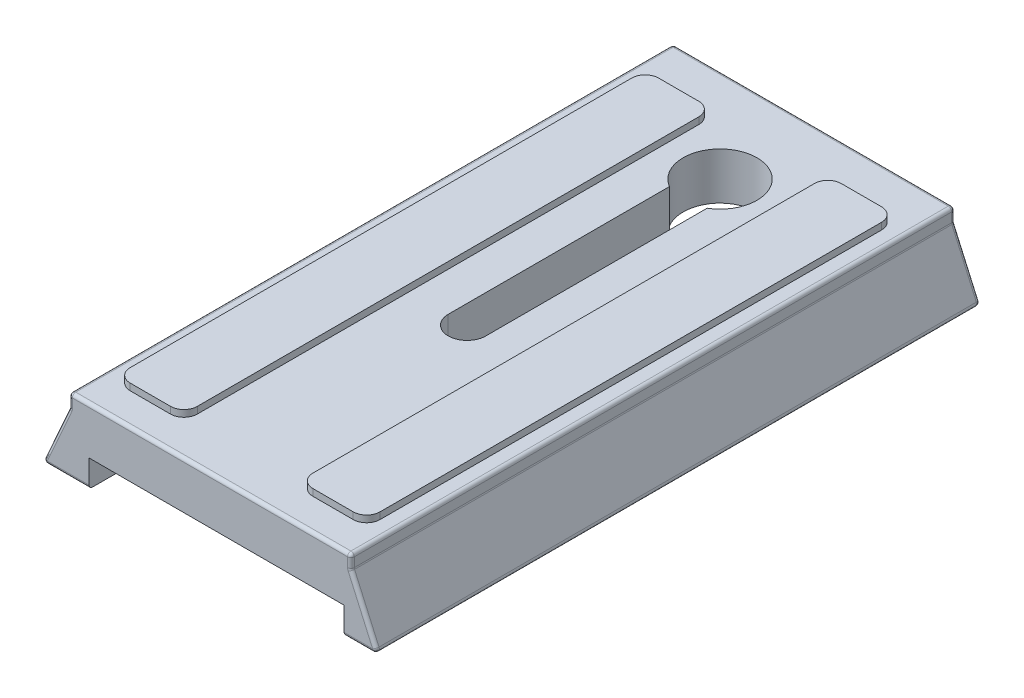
ISO-10303-21;
HEADER;
FILE_DESCRIPTION(('STEP AP214'),'2;1');
FILE_NAME('part.step','',(''),(''),'','','');
FILE_SCHEMA(('AUTOMOTIVE_DESIGN { 1 0 10303 214 1 1 1 1 }'));
ENDSEC;
DATA;
#1=APPLICATION_CONTEXT('core data for automotive mechanical design processes');
#2=APPLICATION_PROTOCOL_DEFINITION('international standard','automotive_design',2000,#1);
#3=PRODUCT_CONTEXT('',#1,'mechanical');
#4=PRODUCT('Part','Part','',(#3));
#5=PRODUCT_RELATED_PRODUCT_CATEGORY('part','',(#4));
#6=PRODUCT_DEFINITION_FORMATION('','',#4);
#7=PRODUCT_DEFINITION_CONTEXT('part definition',#1,'design');
#8=PRODUCT_DEFINITION('design','',#6,#7);
#9=PRODUCT_DEFINITION_SHAPE('','',#8);
#10=(LENGTH_UNIT() NAMED_UNIT(*) SI_UNIT(.MILLI.,.METRE.));
#11=(NAMED_UNIT(*) PLANE_ANGLE_UNIT() SI_UNIT($,.RADIAN.));
#12=(NAMED_UNIT(*) SI_UNIT($,.STERADIAN.) SOLID_ANGLE_UNIT());
#13=UNCERTAINTY_MEASURE_WITH_UNIT(LENGTH_MEASURE(1.E-05),#10,'distance_accuracy_value','');
#14=(GEOMETRIC_REPRESENTATION_CONTEXT(3) GLOBAL_UNCERTAINTY_ASSIGNED_CONTEXT((#13)) GLOBAL_UNIT_ASSIGNED_CONTEXT((#10,
#11,#12)) REPRESENTATION_CONTEXT('',''));
#15=CARTESIAN_POINT('',(0.,0.,0.));
#16=DIRECTION('',(0.,0.,1.));
#17=DIRECTION('',(1.,0.,0.));
#18=AXIS2_PLACEMENT_3D('',#15,#16,#17);
#19=CARTESIAN_POINT('',(4.,11.,-90.));
#20=DIRECTION('',(0.,1.,0.));
#21=DIRECTION('',(0.,0.,1.));
#22=AXIS2_PLACEMENT_3D('',#19,#20,#21);
#23=PLANE('',#22);
#24=DIRECTION('',(0.,0.,1.));
#25=VECTOR('',#24,1.);
#26=CARTESIAN_POINT('',(4.5,11.,-90.));
#27=LINE('',#26,#25);
#28=CARTESIAN_POINT('',(4.5,11.,-89.5));
#29=VERTEX_POINT('',#28);
#30=CARTESIAN_POINT('',(4.5,11.,-0.5));
#31=VERTEX_POINT('',#30);
#32=EDGE_CURVE('E844',#29,#31,#27,.T.);
#33=ORIENTED_EDGE('',*,*,#32,.T.);
#34=DIRECTION('',(-1.,0.,0.));
#35=VECTOR('',#34,1.);
#36=CARTESIAN_POINT('',(4.,11.,-0.5));
#37=LINE('',#36,#35);
#38=CARTESIAN_POINT('',(45.5,11.,-0.5));
#39=VERTEX_POINT('',#38);
#40=EDGE_CURVE('E848',#31,#39,#37,.F.);
#41=ORIENTED_EDGE('',*,*,#40,.T.);
#42=DIRECTION('',(0.,0.,1.));
#43=VECTOR('',#42,1.);
#44=CARTESIAN_POINT('',(45.5,11.,-90.));
#45=LINE('',#44,#43);
#46=CARTESIAN_POINT('',(45.5,11.,-89.5));
#47=VERTEX_POINT('',#46);
#48=EDGE_CURVE('E846',#39,#47,#45,.F.);
#49=ORIENTED_EDGE('',*,*,#48,.T.);
#50=DIRECTION('',(-1.,0.,0.));
#51=VECTOR('',#50,1.);
#52=CARTESIAN_POINT('',(4.,11.,-89.5));
#53=LINE('',#52,#51);
#54=EDGE_CURVE('E842',#47,#29,#53,.T.);
#55=ORIENTED_EDGE('',*,*,#54,.T.);
#56=EDGE_LOOP('',(#33,#41,#49,#55));
#57=FACE_BOUND('',#56,.T.);
#58=DIRECTION('',(1.,0.,0.));
#59=VECTOR('',#58,1.);
#60=CARTESIAN_POINT('',(14.3872535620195,11.,-4.72723987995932));
#61=LINE('',#60,#59);
#62=CARTESIAN_POINT('',(8.38725356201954,11.,-4.72723987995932));
#63=VERTEX_POINT('',#62);
#64=CARTESIAN_POINT('',(14.3872535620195,11.,-4.72723987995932));
#65=VERTEX_POINT('',#64);
#66=EDGE_CURVE('E483',#63,#65,#61,.T.);
#67=ORIENTED_EDGE('',*,*,#66,.F.);
#68=CARTESIAN_POINT('',(8.38725356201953,11.,-6.72723987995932));
#69=DIRECTION('',(0.,1.,0.));
#70=DIRECTION('',(0.,0.,1.));
#71=AXIS2_PLACEMENT_3D('',#68,#69,#70);
#72=CIRCLE('',#71,2.);
#73=CARTESIAN_POINT('',(6.38725356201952,11.,-6.72723987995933));
#74=VERTEX_POINT('',#73);
#75=EDGE_CURVE('E480',#74,#63,#72,.T.);
#76=ORIENTED_EDGE('',*,*,#75,.F.);
#77=DIRECTION('',(0.,0.,1.));
#78=VECTOR('',#77,1.);
#79=CARTESIAN_POINT('',(6.38725356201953,11.,-81.4507331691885));
#80=LINE('',#79,#78);
#81=CARTESIAN_POINT('',(6.38725356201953,11.,-81.4507331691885));
#82=VERTEX_POINT('',#81);
#83=EDGE_CURVE('E493',#82,#74,#80,.T.);
#84=ORIENTED_EDGE('',*,*,#83,.F.);
#85=CARTESIAN_POINT('',(8.38725356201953,11.,-81.4507331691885));
#86=DIRECTION('',(0.,1.,0.));
#87=DIRECTION('',(0.,0.,-1.));
#88=AXIS2_PLACEMENT_3D('',#85,#86,#87);
#89=CIRCLE('',#88,2.);
#90=CARTESIAN_POINT('',(8.38725356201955,11.,-83.4507331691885));
#91=VERTEX_POINT('',#90);
#92=EDGE_CURVE('E517',#91,#82,#89,.T.);
#93=ORIENTED_EDGE('',*,*,#92,.F.);
#94=DIRECTION('',(-1.,0.,0.));
#95=VECTOR('',#94,1.);
#96=CARTESIAN_POINT('',(14.3872535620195,11.,-83.4507331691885));
#97=LINE('',#96,#95);
#98=CARTESIAN_POINT('',(14.3872535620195,11.,-83.4507331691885));
#99=VERTEX_POINT('',#98);
#100=EDGE_CURVE('E515',#99,#91,#97,.T.);
#101=ORIENTED_EDGE('',*,*,#100,.F.);
#102=CARTESIAN_POINT('',(14.3872535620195,11.,-81.4507331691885));
#103=DIRECTION('',(0.,1.,0.));
#104=DIRECTION('',(0.,0.,1.));
#105=AXIS2_PLACEMENT_3D('',#102,#103,#104);
#106=CIRCLE('',#105,2.);
#107=CARTESIAN_POINT('',(16.3872535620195,11.,-81.4507331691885));
#108=VERTEX_POINT('',#107);
#109=EDGE_CURVE('E513',#108,#99,#106,.T.);
#110=ORIENTED_EDGE('',*,*,#109,.F.);
#111=DIRECTION('',(0.,0.,-1.));
#112=VECTOR('',#111,1.);
#113=CARTESIAN_POINT('',(16.3872535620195,11.,-81.4507331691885));
#114=LINE('',#113,#112);
#115=CARTESIAN_POINT('',(16.3872535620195,11.,-6.72723987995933));
#116=VERTEX_POINT('',#115);
#117=EDGE_CURVE('E511',#116,#108,#114,.T.);
#118=ORIENTED_EDGE('',*,*,#117,.F.);
#119=CARTESIAN_POINT('',(14.3872535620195,11.,-6.72723987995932));
#120=DIRECTION('',(0.,1.,0.));
#121=DIRECTION('',(0.,0.,-1.));
#122=AXIS2_PLACEMENT_3D('',#119,#120,#121);
#123=CIRCLE('',#122,2.);
#124=EDGE_CURVE('E509',#65,#116,#123,.T.);
#125=ORIENTED_EDGE('',*,*,#124,.F.);
#126=EDGE_LOOP('',(#67,#76,#84,#93,#101,#110,#118,#125));
#127=FACE_BOUND('',#126,.T.);
#128=CARTESIAN_POINT('',(25.,11.,-76.));
#129=DIRECTION('',(0.,1.,0.));
#130=DIRECTION('',(0.,0.,1.));
#131=AXIS2_PLACEMENT_3D('',#128,#129,#130);
#132=CIRCLE('',#131,5.5);
#133=CARTESIAN_POINT('',(27.8,11.,-71.2660798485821));
#134=VERTEX_POINT('',#133);
#135=CARTESIAN_POINT('',(22.2,11.,-71.2660798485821));
#136=VERTEX_POINT('',#135);
#137=EDGE_CURVE('E624',#134,#136,#132,.T.);
#138=ORIENTED_EDGE('',*,*,#137,.F.);
#139=DIRECTION('',(0.,0.,-1.));
#140=VECTOR('',#139,1.);
#141=CARTESIAN_POINT('',(27.8,11.,-90.));
#142=LINE('',#141,#140);
#143=CARTESIAN_POINT('',(27.8,11.,-38.3));
#144=VERTEX_POINT('',#143);
#145=EDGE_CURVE('E608',#144,#134,#142,.T.);
#146=ORIENTED_EDGE('',*,*,#145,.F.);
#147=CARTESIAN_POINT('',(25.,11.,-38.3));
#148=DIRECTION('',(0.,1.,0.));
#149=DIRECTION('',(0.,0.,1.));
#150=AXIS2_PLACEMENT_3D('',#147,#148,#149);
#151=CIRCLE('',#150,2.79999999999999);
#152=CARTESIAN_POINT('',(22.2,11.,-38.3));
#153=VERTEX_POINT('',#152);
#154=EDGE_CURVE('E619',#153,#144,#151,.T.);
#155=ORIENTED_EDGE('',*,*,#154,.F.);
#156=DIRECTION('',(0.,0.,1.));
#157=VECTOR('',#156,1.);
#158=CARTESIAN_POINT('',(22.2,11.,-90.));
#159=LINE('',#158,#157);
#160=EDGE_CURVE('E622',#136,#153,#159,.T.);
#161=ORIENTED_EDGE('',*,*,#160,.F.);
#162=EDGE_LOOP('',(#138,#146,#155,#161));
#163=FACE_BOUND('',#162,.T.);
#164=DIRECTION('',(-1.,0.,0.));
#165=VECTOR('',#164,1.);
#166=CARTESIAN_POINT('',(35.6127464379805,11.,-83.4507331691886));
#167=LINE('',#166,#165);
#168=CARTESIAN_POINT('',(41.6127464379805,11.,-83.4507331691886));
#169=VERTEX_POINT('',#168);
#170=CARTESIAN_POINT('',(35.6127464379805,11.,-83.4507331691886));
#171=VERTEX_POINT('',#170);
#172=EDGE_CURVE('E972',#169,#171,#167,.T.);
#173=ORIENTED_EDGE('',*,*,#172,.F.);
#174=CARTESIAN_POINT('',(41.6127464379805,11.,-81.4507331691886));
#175=DIRECTION('',(0.,1.,0.));
#176=DIRECTION('',(0.,0.,1.));
#177=AXIS2_PLACEMENT_3D('',#174,#175,#176);
#178=CIRCLE('',#177,2.);
#179=CARTESIAN_POINT('',(43.6127464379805,11.,-81.4507331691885));
#180=VERTEX_POINT('',#179);
#181=EDGE_CURVE('E478',#180,#169,#178,.T.);
#182=ORIENTED_EDGE('',*,*,#181,.F.);
#183=DIRECTION('',(0.,0.,-1.));
#184=VECTOR('',#183,1.);
#185=CARTESIAN_POINT('',(43.6127464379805,11.,-81.4507331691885));
#186=LINE('',#185,#184);
#187=CARTESIAN_POINT('',(43.6127464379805,11.,-6.72723987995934));
#188=VERTEX_POINT('',#187);
#189=EDGE_CURVE('E474',#188,#180,#186,.T.);
#190=ORIENTED_EDGE('',*,*,#189,.F.);
#191=CARTESIAN_POINT('',(41.6127464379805,11.,-6.72723987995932));
#192=DIRECTION('',(0.,1.,0.));
#193=DIRECTION('',(0.,0.,-1.));
#194=AXIS2_PLACEMENT_3D('',#191,#192,#193);
#195=CIRCLE('',#194,2.);
#196=CARTESIAN_POINT('',(41.6127464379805,11.,-4.72723987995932));
#197=VERTEX_POINT('',#196);
#198=EDGE_CURVE('E986',#197,#188,#195,.T.);
#199=ORIENTED_EDGE('',*,*,#198,.F.);
#200=DIRECTION('',(1.,0.,0.));
#201=VECTOR('',#200,1.);
#202=CARTESIAN_POINT('',(35.6127464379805,11.,-4.72723987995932));
#203=LINE('',#202,#201);
#204=CARTESIAN_POINT('',(35.6127464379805,11.,-4.72723987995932));
#205=VERTEX_POINT('',#204);
#206=EDGE_CURVE('E984',#205,#197,#203,.T.);
#207=ORIENTED_EDGE('',*,*,#206,.F.);
#208=CARTESIAN_POINT('',(35.6127464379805,11.,-6.72723987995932));
#209=DIRECTION('',(0.,1.,0.));
#210=DIRECTION('',(0.,0.,1.));
#211=AXIS2_PLACEMENT_3D('',#208,#209,#210);
#212=CIRCLE('',#211,2.);
#213=CARTESIAN_POINT('',(33.6127464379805,11.,-6.72723987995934));
#214=VERTEX_POINT('',#213);
#215=EDGE_CURVE('E982',#214,#205,#212,.T.);
#216=ORIENTED_EDGE('',*,*,#215,.F.);
#217=DIRECTION('',(0.,0.,1.));
#218=VECTOR('',#217,1.);
#219=CARTESIAN_POINT('',(33.6127464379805,11.,-81.4507331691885));
#220=LINE('',#219,#218);
#221=CARTESIAN_POINT('',(33.6127464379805,11.,-81.4507331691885));
#222=VERTEX_POINT('',#221);
#223=EDGE_CURVE('E980',#222,#214,#220,.T.);
#224=ORIENTED_EDGE('',*,*,#223,.F.);
#225=CARTESIAN_POINT('',(35.6127464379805,11.,-81.4507331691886));
#226=DIRECTION('',(0.,1.,0.));
#227=DIRECTION('',(0.,0.,-1.));
#228=AXIS2_PLACEMENT_3D('',#225,#226,#227);
#229=CIRCLE('',#228,2.);
#230=EDGE_CURVE('E974',#171,#222,#229,.T.);
#231=ORIENTED_EDGE('',*,*,#230,.F.);
#232=EDGE_LOOP('',(#173,#182,#190,#199,#207,#216,#224,#231));
#233=FACE_BOUND('',#232,.T.);
#234=ADVANCED_FACE('F37',(#57,#127,#163,#233),#23,.T.);
#235=CARTESIAN_POINT('',(0.,0.,-90.));
#236=DIRECTION('',(0.,-1.,0.));
#237=DIRECTION('',(0.,0.,-1.));
#238=AXIS2_PLACEMENT_3D('',#235,#236,#237);
#239=PLANE('',#238);
#240=DIRECTION('',(0.,0.,1.));
#241=VECTOR('',#240,1.);
#242=CARTESIAN_POINT('',(49.2306190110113,0.,-90.));
#243=LINE('',#242,#241);
#244=CARTESIAN_POINT('',(49.2306190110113,0.,-89.5));
#245=VERTEX_POINT('',#244);
#246=CARTESIAN_POINT('',(49.2306190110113,0.,-0.5));
#247=VERTEX_POINT('',#246);
#248=EDGE_CURVE('E768',#245,#247,#243,.T.);
#249=ORIENTED_EDGE('',*,*,#248,.T.);
#250=DIRECTION('',(1.,0.,0.));
#251=VECTOR('',#250,1.);
#252=CARTESIAN_POINT('',(0.,0.,-0.5));
#253=LINE('',#252,#251);
#254=CARTESIAN_POINT('',(44.9441860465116,0.,-0.5));
#255=VERTEX_POINT('',#254);
#256=EDGE_CURVE('E817',#247,#255,#253,.F.);
#257=ORIENTED_EDGE('',*,*,#256,.T.);
#258=DIRECTION('',(0.110938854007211,0.,0.993827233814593));
#259=VECTOR('',#258,1.);
#260=CARTESIAN_POINT('',(45.,0.,0.));
#261=LINE('',#260,#259);
#262=CARTESIAN_POINT('',(40.262005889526,0.,-42.4445305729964));
#263=VERTEX_POINT('',#262);
#264=EDGE_CURVE('E692',#263,#255,#261,.T.);
#265=ORIENTED_EDGE('',*,*,#264,.F.);
#266=CARTESIAN_POINT('',(40.7589195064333,0.,-42.5));
#267=DIRECTION('',(0.,-1.,0.));
#268=DIRECTION('',(0.,0.,-1.));
#269=AXIS2_PLACEMENT_3D('',#266,#267,#268);
#270=CIRCLE('',#269,0.5);
#271=CARTESIAN_POINT('',(40.7589195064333,0.,-43.));
#272=VERTEX_POINT('',#271);
#273=EDGE_CURVE('E762',#263,#272,#270,.T.);
#274=ORIENTED_EDGE('',*,*,#273,.T.);
#275=DIRECTION('',(-1.,0.,0.));
#276=VECTOR('',#275,1.);
#277=CARTESIAN_POINT('',(46.,0.,-43.));
#278=LINE('',#277,#276);
#279=CARTESIAN_POINT('',(44.,0.,-43.));
#280=VERTEX_POINT('',#279);
#281=EDGE_CURVE('E689',#280,#272,#278,.T.);
#282=ORIENTED_EDGE('',*,*,#281,.F.);
#283=CARTESIAN_POINT('',(44.,0.,-45.));
#284=DIRECTION('',(0.,-1.,0.));
#285=DIRECTION('',(0.,0.,-1.));
#286=AXIS2_PLACEMENT_3D('',#283,#284,#285);
#287=CIRCLE('',#286,2.);
#288=CARTESIAN_POINT('',(46.,0.,-45.));
#289=VERTEX_POINT('',#288);
#290=EDGE_CURVE('E753',#280,#289,#287,.F.);
#291=ORIENTED_EDGE('',*,*,#290,.T.);
#292=DIRECTION('',(0.,0.,1.));
#293=VECTOR('',#292,1.);
#294=CARTESIAN_POINT('',(46.,0.,-90.));
#295=LINE('',#294,#293);
#296=CARTESIAN_POINT('',(46.,0.,-89.5));
#297=VERTEX_POINT('',#296);
#298=EDGE_CURVE('E687',#297,#289,#295,.T.);
#299=ORIENTED_EDGE('',*,*,#298,.F.);
#300=DIRECTION('',(1.,0.,0.));
#301=VECTOR('',#300,1.);
#302=CARTESIAN_POINT('',(49.2306190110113,0.,-89.5));
#303=LINE('',#302,#301);
#304=EDGE_CURVE('E815',#297,#245,#303,.T.);
#305=ORIENTED_EDGE('',*,*,#304,.T.);
#306=EDGE_LOOP('',(#249,#257,#265,#274,#282,#291,#299,#305));
#307=FACE_BOUND('',#306,.T.);
#308=ADVANCED_FACE('F1042',(#307),#239,.T.);
#309=CARTESIAN_POINT('',(4.,9.,-90.));
#310=DIRECTION('',(-0.913811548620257,0.406138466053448,0.));
#311=DIRECTION('',(-0.406138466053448,-0.913811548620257,0.));
#312=AXIS2_PLACEMENT_3D('',#309,#310,#311);
#313=PLANE('',#312);
#314=DIRECTION('',(0.,0.,1.));
#315=VECTOR('',#314,1.);
#316=CARTESIAN_POINT('',(0.312475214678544,0.703069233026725,-90.));
#317=LINE('',#316,#315);
#318=CARTESIAN_POINT('',(0.312475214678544,0.703069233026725,-89.5));
#319=VERTEX_POINT('',#318);
#320=CARTESIAN_POINT('',(0.312475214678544,0.703069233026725,-0.5));
#321=VERTEX_POINT('',#320);
#322=EDGE_CURVE('E774',#319,#321,#317,.T.);
#323=ORIENTED_EDGE('',*,*,#322,.T.);
#324=DIRECTION('',(-0.406138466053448,-0.913811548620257,0.));
#325=VECTOR('',#324,1.);
#326=CARTESIAN_POINT('',(4.,9.,-0.5));
#327=LINE('',#326,#325);
#328=CARTESIAN_POINT('',(3.95690577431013,8.90303799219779,-0.5));
#329=VERTEX_POINT('',#328);
#330=EDGE_CURVE('E813',#321,#329,#327,.F.);
#331=ORIENTED_EDGE('',*,*,#330,.T.);
#332=DIRECTION('',(0.,0.,1.));
#333=VECTOR('',#332,1.);
#334=CARTESIAN_POINT('',(3.95690577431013,8.90303799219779,-90.));
#335=LINE('',#334,#333);
#336=CARTESIAN_POINT('',(3.95690577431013,8.90303799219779,-89.5));
#337=VERTEX_POINT('',#336);
#338=EDGE_CURVE('E809',#329,#337,#335,.F.);
#339=ORIENTED_EDGE('',*,*,#338,.T.);
#340=DIRECTION('',(-0.406138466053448,-0.913811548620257,0.));
#341=VECTOR('',#340,1.);
#342=CARTESIAN_POINT('',(0.312475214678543,0.703069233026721,-89.5));
#343=LINE('',#342,#341);
#344=EDGE_CURVE('E811',#337,#319,#343,.T.);
#345=ORIENTED_EDGE('',*,*,#344,.T.);
#346=EDGE_LOOP('',(#323,#331,#339,#345));
#347=FACE_BOUND('',#346,.T.);
#348=ADVANCED_FACE('F1048',(#347),#313,.T.);
#349=CARTESIAN_POINT('',(4.,11.,-90.));
#350=DIRECTION('',(-1.,0.,0.));
#351=DIRECTION('',(0.,0.,1.));
#352=AXIS2_PLACEMENT_3D('',#349,#350,#351);
#353=PLANE('',#352);
#354=DIRECTION('',(0.,-1.,0.));
#355=VECTOR('',#354,1.);
#356=CARTESIAN_POINT('',(4.,11.,-0.5));
#357=LINE('',#356,#355);
#358=CARTESIAN_POINT('',(4.,9.10610722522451,-0.5));
#359=VERTEX_POINT('',#358);
#360=CARTESIAN_POINT('',(4.,10.5,-0.5));
#361=VERTEX_POINT('',#360);
#362=EDGE_CURVE('E855',#359,#361,#357,.F.);
#363=ORIENTED_EDGE('',*,*,#362,.T.);
#364=DIRECTION('',(0.,0.,1.));
#365=VECTOR('',#364,1.);
#366=CARTESIAN_POINT('',(4.,10.5,-90.));
#367=LINE('',#366,#365);
#368=CARTESIAN_POINT('',(4.,10.5,-89.5));
#369=VERTEX_POINT('',#368);
#370=EDGE_CURVE('E858',#361,#369,#367,.F.);
#371=ORIENTED_EDGE('',*,*,#370,.T.);
#372=DIRECTION('',(0.,-1.,0.));
#373=VECTOR('',#372,1.);
#374=CARTESIAN_POINT('',(4.,9.,-89.5));
#375=LINE('',#374,#373);
#376=CARTESIAN_POINT('',(4.,9.10610722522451,-89.5));
#377=VERTEX_POINT('',#376);
#378=EDGE_CURVE('E853',#369,#377,#375,.T.);
#379=ORIENTED_EDGE('',*,*,#378,.T.);
#380=DIRECTION('',(0.,0.,1.));
#381=VECTOR('',#380,1.);
#382=CARTESIAN_POINT('',(4.,9.10610722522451,0.));
#383=LINE('',#382,#381);
#384=EDGE_CURVE('E851',#377,#359,#383,.T.);
#385=ORIENTED_EDGE('',*,*,#384,.T.);
#386=EDGE_LOOP('',(#363,#371,#379,#385));
#387=FACE_BOUND('',#386,.T.);
#388=ADVANCED_FACE('F1055',(#387),#353,.T.);
#389=CARTESIAN_POINT('',(46.,11.,-90.));
#390=DIRECTION('',(1.,0.,0.));
#391=DIRECTION('',(0.,0.,-1.));
#392=AXIS2_PLACEMENT_3D('',#389,#390,#391);
#393=PLANE('',#392);
#394=DIRECTION('',(0.,1.,0.));
#395=VECTOR('',#394,1.);
#396=CARTESIAN_POINT('',(46.,11.,-0.5));
#397=LINE('',#396,#395);
#398=CARTESIAN_POINT('',(46.,10.5,-0.5));
#399=VERTEX_POINT('',#398);
#400=CARTESIAN_POINT('',(46.,9.10610722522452,-0.5));
#401=VERTEX_POINT('',#400);
#402=EDGE_CURVE('E837',#399,#401,#397,.F.);
#403=ORIENTED_EDGE('',*,*,#402,.T.);
#404=DIRECTION('',(0.,0.,1.));
#405=VECTOR('',#404,1.);
#406=CARTESIAN_POINT('',(46.,9.10610722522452,-90.));
#407=LINE('',#406,#405);
#408=CARTESIAN_POINT('',(46.,9.10610722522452,-89.5));
#409=VERTEX_POINT('',#408);
#410=EDGE_CURVE('E840',#401,#409,#407,.F.);
#411=ORIENTED_EDGE('',*,*,#410,.T.);
#412=DIRECTION('',(0.,1.,0.));
#413=VECTOR('',#412,1.);
#414=CARTESIAN_POINT('',(46.,11.,-89.5));
#415=LINE('',#414,#413);
#416=CARTESIAN_POINT('',(46.,10.5,-89.5));
#417=VERTEX_POINT('',#416);
#418=EDGE_CURVE('E835',#409,#417,#415,.T.);
#419=ORIENTED_EDGE('',*,*,#418,.T.);
#420=DIRECTION('',(0.,0.,1.));
#421=VECTOR('',#420,1.);
#422=CARTESIAN_POINT('',(46.,10.5,-90.));
#423=LINE('',#422,#421);
#424=EDGE_CURVE('E833',#417,#399,#423,.T.);
#425=ORIENTED_EDGE('',*,*,#424,.T.);
#426=EDGE_LOOP('',(#403,#411,#419,#425));
#427=FACE_BOUND('',#426,.T.);
#428=ADVANCED_FACE('F1057',(#427),#393,.T.);
#429=CARTESIAN_POINT('',(46.,9.,-90.));
#430=DIRECTION('',(0.913811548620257,0.406138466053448,0.));
#431=DIRECTION('',(-0.406138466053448,0.913811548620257,0.));
#432=AXIS2_PLACEMENT_3D('',#429,#430,#431);
#433=PLANE('',#432);
#434=DIRECTION('',(0.,0.,1.));
#435=VECTOR('',#434,1.);
#436=CARTESIAN_POINT('',(46.0430942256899,8.90303799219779,0.));
#437=LINE('',#436,#435);
#438=CARTESIAN_POINT('',(46.0430942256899,8.90303799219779,-89.5));
#439=VERTEX_POINT('',#438);
#440=CARTESIAN_POINT('',(46.0430942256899,8.90303799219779,-0.5));
#441=VERTEX_POINT('',#440);
#442=EDGE_CURVE('E827',#439,#441,#437,.T.);
#443=ORIENTED_EDGE('',*,*,#442,.T.);
#444=DIRECTION('',(-0.406138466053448,0.913811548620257,0.));
#445=VECTOR('',#444,1.);
#446=CARTESIAN_POINT('',(46.,9.,-0.5));
#447=LINE('',#446,#445);
#448=CARTESIAN_POINT('',(49.6875247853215,0.703069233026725,-0.5));
#449=VERTEX_POINT('',#448);
#450=EDGE_CURVE('E831',#441,#449,#447,.F.);
#451=ORIENTED_EDGE('',*,*,#450,.T.);
#452=DIRECTION('',(0.,0.,1.));
#453=VECTOR('',#452,1.);
#454=CARTESIAN_POINT('',(49.6875247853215,0.703069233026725,-90.));
#455=LINE('',#454,#453);
#456=CARTESIAN_POINT('',(49.6875247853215,0.703069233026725,-89.5));
#457=VERTEX_POINT('',#456);
#458=EDGE_CURVE('E771',#449,#457,#455,.F.);
#459=ORIENTED_EDGE('',*,*,#458,.T.);
#460=DIRECTION('',(-0.406138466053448,0.913811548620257,0.));
#461=VECTOR('',#460,1.);
#462=CARTESIAN_POINT('',(46.,9.,-89.5));
#463=LINE('',#462,#461);
#464=EDGE_CURVE('E829',#457,#439,#463,.T.);
#465=ORIENTED_EDGE('',*,*,#464,.T.);
#466=EDGE_LOOP('',(#443,#451,#459,#465));
#467=FACE_BOUND('',#466,.T.);
#468=ADVANCED_FACE('F1060',(#467),#433,.T.);
#469=DIRECTION('',(0.,0.,-1.));
#470=VECTOR('',#469,1.);
#471=CARTESIAN_POINT('',(7.,0.,-38.5));
#472=LINE('',#471,#470);
#473=CARTESIAN_POINT('',(7.,0.,-0.5));
#474=VERTEX_POINT('',#473);
#475=CARTESIAN_POINT('',(7.,0.,-38.5));
#476=VERTEX_POINT('',#475);
#477=EDGE_CURVE('E695',#474,#476,#472,.T.);
#478=ORIENTED_EDGE('',*,*,#477,.F.);
#479=DIRECTION('',(1.,0.,0.));
#480=VECTOR('',#479,1.);
#481=CARTESIAN_POINT('',(0.,0.,-0.5));
#482=LINE('',#481,#480);
#483=CARTESIAN_POINT('',(0.769380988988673,0.,-0.5));
#484=VERTEX_POINT('',#483);
#485=EDGE_CURVE('E825',#474,#484,#482,.F.);
#486=ORIENTED_EDGE('',*,*,#485,.T.);
#487=DIRECTION('',(0.,0.,1.));
#488=VECTOR('',#487,1.);
#489=CARTESIAN_POINT('',(0.769380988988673,0.,-90.));
#490=LINE('',#489,#488);
#491=CARTESIAN_POINT('',(0.769380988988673,0.,-89.5));
#492=VERTEX_POINT('',#491);
#493=EDGE_CURVE('E777',#484,#492,#490,.F.);
#494=ORIENTED_EDGE('',*,*,#493,.T.);
#495=DIRECTION('',(1.,0.,0.));
#496=VECTOR('',#495,1.);
#497=CARTESIAN_POINT('',(40.,0.,-89.5));
#498=LINE('',#497,#496);
#499=CARTESIAN_POINT('',(40.,0.,-89.5));
#500=VERTEX_POINT('',#499);
#501=EDGE_CURVE('E823',#492,#500,#498,.T.);
#502=ORIENTED_EDGE('',*,*,#501,.T.);
#503=DIRECTION('',(0.,0.,-1.));
#504=VECTOR('',#503,1.);
#505=CARTESIAN_POINT('',(40.,0.,-90.));
#506=LINE('',#505,#504);
#507=CARTESIAN_POINT('',(40.,0.,-87.4));
#508=VERTEX_POINT('',#507);
#509=EDGE_CURVE('E684',#508,#500,#506,.T.);
#510=ORIENTED_EDGE('',*,*,#509,.F.);
#511=DIRECTION('',(1.,0.,0.));
#512=VECTOR('',#511,1.);
#513=CARTESIAN_POINT('',(40.,0.,-87.4));
#514=LINE('',#513,#512);
#515=CARTESIAN_POINT('',(4.,0.,-87.4));
#516=VERTEX_POINT('',#515);
#517=EDGE_CURVE('E681',#516,#508,#514,.T.);
#518=ORIENTED_EDGE('',*,*,#517,.F.);
#519=DIRECTION('',(0.,0.,-1.));
#520=VECTOR('',#519,1.);
#521=CARTESIAN_POINT('',(4.,0.,-48.5));
#522=LINE('',#521,#520);
#523=CARTESIAN_POINT('',(4.,0.,-48.5));
#524=VERTEX_POINT('',#523);
#525=EDGE_CURVE('E678',#524,#516,#522,.T.);
#526=ORIENTED_EDGE('',*,*,#525,.F.);
#527=CARTESIAN_POINT('',(6.5,0.,-48.5));
#528=DIRECTION('',(0.,-1.,0.));
#529=DIRECTION('',(0.,0.,-1.));
#530=AXIS2_PLACEMENT_3D('',#527,#528,#529);
#531=CIRCLE('',#530,2.5);
#532=CARTESIAN_POINT('',(6.50000000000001,0.,-46.));
#533=VERTEX_POINT('',#532);
#534=EDGE_CURVE('E626',#533,#524,#531,.T.);
#535=ORIENTED_EDGE('',*,*,#534,.F.);
#536=DIRECTION('',(-1.,0.,0.));
#537=VECTOR('',#536,1.);
#538=CARTESIAN_POINT('',(14.4,0.,-46.));
#539=LINE('',#538,#537);
#540=CARTESIAN_POINT('',(14.4,0.,-46.));
#541=VERTEX_POINT('',#540);
#542=EDGE_CURVE('E631',#541,#533,#539,.T.);
#543=ORIENTED_EDGE('',*,*,#542,.F.);
#544=CARTESIAN_POINT('',(14.4,0.,-45.4));
#545=DIRECTION('',(0.,1.,0.));
#546=DIRECTION('',(0.,0.,1.));
#547=AXIS2_PLACEMENT_3D('',#544,#545,#546);
#548=CIRCLE('',#547,0.599999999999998);
#549=CARTESIAN_POINT('',(15.,0.,-45.4));
#550=VERTEX_POINT('',#549);
#551=EDGE_CURVE('E709',#550,#541,#548,.T.);
#552=ORIENTED_EDGE('',*,*,#551,.F.);
#553=DIRECTION('',(0.,0.,-1.));
#554=VECTOR('',#553,1.);
#555=CARTESIAN_POINT('',(15.,0.,-41.6));
#556=LINE('',#555,#554);
#557=CARTESIAN_POINT('',(15.,0.,-41.6));
#558=VERTEX_POINT('',#557);
#559=EDGE_CURVE('E706',#558,#550,#556,.T.);
#560=ORIENTED_EDGE('',*,*,#559,.F.);
#561=CARTESIAN_POINT('',(14.4,0.,-41.6));
#562=DIRECTION('',(0.,1.,0.));
#563=DIRECTION('',(0.,0.,1.));
#564=AXIS2_PLACEMENT_3D('',#561,#562,#563);
#565=CIRCLE('',#564,0.599999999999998);
#566=CARTESIAN_POINT('',(14.4,0.,-41.));
#567=VERTEX_POINT('',#566);
#568=EDGE_CURVE('E703',#567,#558,#565,.T.);
#569=ORIENTED_EDGE('',*,*,#568,.F.);
#570=DIRECTION('',(1.,0.,0.));
#571=VECTOR('',#570,1.);
#572=CARTESIAN_POINT('',(9.50000000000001,0.,-41.));
#573=LINE('',#572,#571);
#574=CARTESIAN_POINT('',(9.50000000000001,0.,-41.));
#575=VERTEX_POINT('',#574);
#576=EDGE_CURVE('E700',#575,#567,#573,.T.);
#577=ORIENTED_EDGE('',*,*,#576,.F.);
#578=CARTESIAN_POINT('',(9.5,0.,-38.5));
#579=DIRECTION('',(0.,-1.,0.));
#580=DIRECTION('',(0.,0.,1.));
#581=AXIS2_PLACEMENT_3D('',#578,#579,#580);
#582=CIRCLE('',#581,2.5);
#583=EDGE_CURVE('E697',#476,#575,#582,.T.);
#584=ORIENTED_EDGE('',*,*,#583,.F.);
#585=EDGE_LOOP('',(#478,#486,#494,#502,#510,#518,#526,#535,#543,#552,#560,#569,#577,#584));
#586=FACE_BOUND('',#585,.T.);
#587=ADVANCED_FACE('F1051',(#586),#239,.T.);
#588=CARTESIAN_POINT('',(0.,0.,-90.));
#589=DIRECTION('',(0.,0.,1.));
#590=DIRECTION('',(1.,0.,0.));
#591=AXIS2_PLACEMENT_3D('',#588,#589,#590);
#592=PLANE('',#591);
#593=DIRECTION('',(-0.406138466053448,0.913811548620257,0.));
#594=VECTOR('',#593,1.);
#595=CARTESIAN_POINT('',(49.2306190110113,0.499999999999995,-90.));
#596=LINE('',#595,#594);
#597=CARTESIAN_POINT('',(45.5861884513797,8.69996875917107,-90.));
#598=VERTEX_POINT('',#597);
#599=CARTESIAN_POINT('',(49.2306190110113,0.499999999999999,-90.));
#600=VERTEX_POINT('',#599);
#601=EDGE_CURVE('E54',#598,#600,#596,.F.);
#602=ORIENTED_EDGE('',*,*,#601,.T.);
#603=DIRECTION('',(1.,0.,0.));
#604=VECTOR('',#603,1.);
#605=CARTESIAN_POINT('',(46.,0.5,-90.));
#606=LINE('',#605,#604);
#607=CARTESIAN_POINT('',(46.,0.5,-90.));
#608=VERTEX_POINT('',#607);
#609=EDGE_CURVE('E875',#600,#608,#606,.F.);
#610=ORIENTED_EDGE('',*,*,#609,.T.);
#611=DIRECTION('',(0.,-1.,0.));
#612=VECTOR('',#611,1.);
#613=CARTESIAN_POINT('',(46.,4.,-90.));
#614=LINE('',#613,#612);
#615=CARTESIAN_POINT('',(46.,4.,-90.));
#616=VERTEX_POINT('',#615);
#617=EDGE_CURVE('E736',#616,#608,#614,.T.);
#618=ORIENTED_EDGE('',*,*,#617,.F.);
#619=DIRECTION('',(1.,0.,0.));
#620=VECTOR('',#619,1.);
#621=CARTESIAN_POINT('',(40.,4.,-90.));
#622=LINE('',#621,#620);
#623=CARTESIAN_POINT('',(40.,4.,-90.));
#624=VERTEX_POINT('',#623);
#625=EDGE_CURVE('E640',#624,#616,#622,.T.);
#626=ORIENTED_EDGE('',*,*,#625,.F.);
#627=DIRECTION('',(0.,-1.,0.));
#628=VECTOR('',#627,1.);
#629=CARTESIAN_POINT('',(40.,4.,-90.));
#630=LINE('',#629,#628);
#631=CARTESIAN_POINT('',(40.,0.5,-90.));
#632=VERTEX_POINT('',#631);
#633=EDGE_CURVE('E739',#624,#632,#630,.T.);
#634=ORIENTED_EDGE('',*,*,#633,.T.);
#635=DIRECTION('',(1.,0.,0.));
#636=VECTOR('',#635,1.);
#637=CARTESIAN_POINT('',(0.769380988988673,0.5,-90.));
#638=LINE('',#637,#636);
#639=CARTESIAN_POINT('',(0.769380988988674,0.5,-90.));
#640=VERTEX_POINT('',#639);
#641=EDGE_CURVE('E873',#632,#640,#638,.F.);
#642=ORIENTED_EDGE('',*,*,#641,.T.);
#643=DIRECTION('',(-0.406138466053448,-0.913811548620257,0.));
#644=VECTOR('',#643,1.);
#645=CARTESIAN_POINT('',(4.45690577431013,8.79693076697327,-90.));
#646=LINE('',#645,#644);
#647=CARTESIAN_POINT('',(4.41381154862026,8.69996875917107,-90.));
#648=VERTEX_POINT('',#647);
#649=EDGE_CURVE('E869',#640,#648,#646,.F.);
#650=ORIENTED_EDGE('',*,*,#649,.T.);
#651=CARTESIAN_POINT('',(3.5,9.10610722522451,-90.));
#652=DIRECTION('',(0.,0.,1.));
#653=DIRECTION('',(1.,0.,0.));
#654=AXIS2_PLACEMENT_3D('',#651,#652,#653);
#655=CIRCLE('',#654,1.);
#656=CARTESIAN_POINT('',(4.5,9.10610722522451,-90.));
#657=VERTEX_POINT('',#656);
#658=EDGE_CURVE('E866',#657,#648,#655,.F.);
#659=ORIENTED_EDGE('',*,*,#658,.F.);
#660=DIRECTION('',(0.,-1.,0.));
#661=VECTOR('',#660,1.);
#662=CARTESIAN_POINT('',(4.5,11.,-90.));
#663=LINE('',#662,#661);
#664=CARTESIAN_POINT('',(4.5,10.5,-90.));
#665=VERTEX_POINT('',#664);
#666=EDGE_CURVE('E862',#657,#665,#663,.F.);
#667=ORIENTED_EDGE('',*,*,#666,.T.);
#668=DIRECTION('',(-1.,0.,0.));
#669=VECTOR('',#668,1.);
#670=CARTESIAN_POINT('',(46.,10.5,-90.));
#671=LINE('',#670,#669);
#672=CARTESIAN_POINT('',(45.5,10.5,-90.));
#673=VERTEX_POINT('',#672);
#674=EDGE_CURVE('E860',#665,#673,#671,.F.);
#675=ORIENTED_EDGE('',*,*,#674,.T.);
#676=DIRECTION('',(0.,1.,0.));
#677=VECTOR('',#676,1.);
#678=CARTESIAN_POINT('',(45.5,9.,-90.));
#679=LINE('',#678,#677);
#680=CARTESIAN_POINT('',(45.5,9.10610722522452,-90.));
#681=VERTEX_POINT('',#680);
#682=EDGE_CURVE('E864',#673,#681,#679,.F.);
#683=ORIENTED_EDGE('',*,*,#682,.T.);
#684=CARTESIAN_POINT('',(46.5,9.10610722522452,-90.));
#685=DIRECTION('',(0.,0.,1.));
#686=DIRECTION('',(1.,0.,0.));
#687=AXIS2_PLACEMENT_3D('',#684,#685,#686);
#688=CIRCLE('',#687,1.);
#689=EDGE_CURVE('E59',#598,#681,#688,.F.);
#690=ORIENTED_EDGE('',*,*,#689,.F.);
#691=EDGE_LOOP('',(#602,#610,#618,#626,#634,#642,#650,#659,#667,#675,#683,#690));
#692=FACE_BOUND('',#691,.T.);
#693=ADVANCED_FACE('F1066',(#692),#592,.F.);
#694=CARTESIAN_POINT('',(0.,0.,0.));
#695=DIRECTION('',(0.,0.,1.));
#696=DIRECTION('',(1.,0.,0.));
#697=AXIS2_PLACEMENT_3D('',#694,#695,#696);
#698=PLANE('',#697);
#699=DIRECTION('',(-0.406138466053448,-0.913811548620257,0.));
#700=VECTOR('',#699,1.);
#701=CARTESIAN_POINT('',(0.456905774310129,-0.203069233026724,0.));
#702=LINE('',#701,#700);
#703=CARTESIAN_POINT('',(4.41381154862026,8.69996875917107,0.));
#704=VERTEX_POINT('',#703);
#705=CARTESIAN_POINT('',(0.769380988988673,0.5,0.));
#706=VERTEX_POINT('',#705);
#707=EDGE_CURVE('E805',#704,#706,#702,.T.);
#708=ORIENTED_EDGE('',*,*,#707,.T.);
#709=DIRECTION('',(1.,0.,0.));
#710=VECTOR('',#709,1.);
#711=CARTESIAN_POINT('',(0.,0.5,0.));
#712=LINE('',#711,#710);
#713=CARTESIAN_POINT('',(7.,0.5,0.));
#714=VERTEX_POINT('',#713);
#715=EDGE_CURVE('E807',#706,#714,#712,.T.);
#716=ORIENTED_EDGE('',*,*,#715,.T.);
#717=DIRECTION('',(0.,-1.,0.));
#718=VECTOR('',#717,1.);
#719=CARTESIAN_POINT('',(7.,4.,0.));
#720=LINE('',#719,#718);
#721=CARTESIAN_POINT('',(7.,4.,0.));
#722=VERTEX_POINT('',#721);
#723=EDGE_CURVE('E730',#722,#714,#720,.T.);
#724=ORIENTED_EDGE('',*,*,#723,.F.);
#725=DIRECTION('',(-1.,0.,0.));
#726=VECTOR('',#725,1.);
#727=CARTESIAN_POINT('',(7.,4.,0.));
#728=LINE('',#727,#726);
#729=CARTESIAN_POINT('',(45.,4.,0.));
#730=VERTEX_POINT('',#729);
#731=EDGE_CURVE('E651',#730,#722,#728,.T.);
#732=ORIENTED_EDGE('',*,*,#731,.F.);
#733=DIRECTION('',(0.,-1.,0.));
#734=VECTOR('',#733,1.);
#735=CARTESIAN_POINT('',(45.,4.,0.));
#736=LINE('',#735,#734);
#737=CARTESIAN_POINT('',(45.,0.5,0.));
#738=VERTEX_POINT('',#737);
#739=EDGE_CURVE('E733',#730,#738,#736,.T.);
#740=ORIENTED_EDGE('',*,*,#739,.T.);
#741=DIRECTION('',(1.,0.,0.));
#742=VECTOR('',#741,1.);
#743=CARTESIAN_POINT('',(0.,0.5,0.));
#744=LINE('',#743,#742);
#745=CARTESIAN_POINT('',(49.2306190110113,0.500000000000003,0.));
#746=VERTEX_POINT('',#745);
#747=EDGE_CURVE('E803',#738,#746,#744,.T.);
#748=ORIENTED_EDGE('',*,*,#747,.T.);
#749=DIRECTION('',(-0.406138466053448,0.913811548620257,0.));
#750=VECTOR('',#749,1.);
#751=CARTESIAN_POINT('',(41.2956715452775,18.3536317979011,0.));
#752=LINE('',#751,#750);
#753=CARTESIAN_POINT('',(45.5861884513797,8.69996875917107,0.));
#754=VERTEX_POINT('',#753);
#755=EDGE_CURVE('E801',#746,#754,#752,.T.);
#756=ORIENTED_EDGE('',*,*,#755,.T.);
#757=CARTESIAN_POINT('',(46.5,9.10610722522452,0.));
#758=DIRECTION('',(0.,0.,1.));
#759=DIRECTION('',(1.,0.,0.));
#760=AXIS2_PLACEMENT_3D('',#757,#758,#759);
#761=CIRCLE('',#760,1.);
#762=CARTESIAN_POINT('',(45.5,9.10610722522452,0.));
#763=VERTEX_POINT('',#762);
#764=EDGE_CURVE('E798',#763,#754,#761,.T.);
#765=ORIENTED_EDGE('',*,*,#764,.F.);
#766=DIRECTION('',(0.,1.,0.));
#767=VECTOR('',#766,1.);
#768=CARTESIAN_POINT('',(45.5,0.,0.));
#769=LINE('',#768,#767);
#770=CARTESIAN_POINT('',(45.5,10.5,0.));
#771=VERTEX_POINT('',#770);
#772=EDGE_CURVE('E796',#763,#771,#769,.T.);
#773=ORIENTED_EDGE('',*,*,#772,.T.);
#774=DIRECTION('',(-1.,0.,0.));
#775=VECTOR('',#774,1.);
#776=CARTESIAN_POINT('',(0.,10.5,0.));
#777=LINE('',#776,#775);
#778=CARTESIAN_POINT('',(4.5,10.5,0.));
#779=VERTEX_POINT('',#778);
#780=EDGE_CURVE('E794',#771,#779,#777,.T.);
#781=ORIENTED_EDGE('',*,*,#780,.T.);
#782=DIRECTION('',(0.,-1.,0.));
#783=VECTOR('',#782,1.);
#784=CARTESIAN_POINT('',(4.5,0.,0.));
#785=LINE('',#784,#783);
#786=CARTESIAN_POINT('',(4.5,9.10610722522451,0.));
#787=VERTEX_POINT('',#786);
#788=EDGE_CURVE('E792',#779,#787,#785,.T.);
#789=ORIENTED_EDGE('',*,*,#788,.T.);
#790=CARTESIAN_POINT('',(3.5,9.10610722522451,0.));
#791=DIRECTION('',(0.,0.,1.));
#792=DIRECTION('',(1.,0.,0.));
#793=AXIS2_PLACEMENT_3D('',#790,#791,#792);
#794=CIRCLE('',#793,1.);
#795=EDGE_CURVE('E789',#704,#787,#794,.T.);
#796=ORIENTED_EDGE('',*,*,#795,.F.);
#797=EDGE_LOOP('',(#708,#716,#724,#732,#740,#748,#756,#765,#773,#781,#789,#796));
#798=FACE_BOUND('',#797,.T.);
#799=ADVANCED_FACE('F1221',(#798),#698,.T.);
#800=CARTESIAN_POINT('',(6.5,4.,-48.5));
#801=DIRECTION('',(0.,-1.,0.));
#802=DIRECTION('',(0.,0.,-1.));
#803=AXIS2_PLACEMENT_3D('',#800,#801,#802);
#804=CYLINDRICAL_SURFACE('',#803,2.5);
#805=ORIENTED_EDGE('',*,*,#534,.T.);
#806=DIRECTION('',(0.,-1.,0.));
#807=VECTOR('',#806,1.);
#808=CARTESIAN_POINT('',(4.,4.,-48.5));
#809=LINE('',#808,#807);
#810=CARTESIAN_POINT('',(4.,4.,-48.5));
#811=VERTEX_POINT('',#810);
#812=EDGE_CURVE('E675',#811,#524,#809,.T.);
#813=ORIENTED_EDGE('',*,*,#812,.F.);
#814=CARTESIAN_POINT('',(6.5,4.,-48.5));
#815=DIRECTION('',(0.,-1.,0.));
#816=DIRECTION('',(0.,0.,-1.));
#817=AXIS2_PLACEMENT_3D('',#814,#815,#816);
#818=CIRCLE('',#817,2.5);
#819=CARTESIAN_POINT('',(6.50000000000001,4.,-46.));
#820=VERTEX_POINT('',#819);
#821=EDGE_CURVE('E627',#820,#811,#818,.T.);
#822=ORIENTED_EDGE('',*,*,#821,.F.);
#823=DIRECTION('',(0.,-1.,0.));
#824=VECTOR('',#823,1.);
#825=CARTESIAN_POINT('',(6.50000000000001,4.,-46.));
#826=LINE('',#825,#824);
#827=EDGE_CURVE('E714',#820,#533,#826,.T.);
#828=ORIENTED_EDGE('',*,*,#827,.T.);
#829=EDGE_LOOP('',(#805,#813,#822,#828));
#830=FACE_BOUND('',#829,.T.);
#831=ADVANCED_FACE('F1332',(#830),#804,.F.);
#832=CARTESIAN_POINT('',(14.4,4.,-46.));
#833=DIRECTION('',(0.,0.,1.));
#834=DIRECTION('',(1.,0.,0.));
#835=AXIS2_PLACEMENT_3D('',#832,#833,#834);
#836=PLANE('',#835);
#837=ORIENTED_EDGE('',*,*,#542,.T.);
#838=ORIENTED_EDGE('',*,*,#827,.F.);
#839=DIRECTION('',(-1.,0.,0.));
#840=VECTOR('',#839,1.);
#841=CARTESIAN_POINT('',(14.4,4.,-46.));
#842=LINE('',#841,#840);
#843=CARTESIAN_POINT('',(14.4,4.,-46.));
#844=VERTEX_POINT('',#843);
#845=EDGE_CURVE('E672',#844,#820,#842,.T.);
#846=ORIENTED_EDGE('',*,*,#845,.F.);
#847=DIRECTION('',(0.,-1.,0.));
#848=VECTOR('',#847,1.);
#849=CARTESIAN_POINT('',(14.4,4.,-46.));
#850=LINE('',#849,#848);
#851=EDGE_CURVE('E717',#844,#541,#850,.T.);
#852=ORIENTED_EDGE('',*,*,#851,.T.);
#853=EDGE_LOOP('',(#837,#838,#846,#852));
#854=FACE_BOUND('',#853,.T.);
#855=ADVANCED_FACE('F1335',(#854),#836,.F.);
#856=CARTESIAN_POINT('',(14.4,4.,-45.4));
#857=DIRECTION('',(0.,-1.,0.));
#858=DIRECTION('',(0.,0.,-1.));
#859=AXIS2_PLACEMENT_3D('',#856,#857,#858);
#860=CYLINDRICAL_SURFACE('',#859,0.599999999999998);
#861=ORIENTED_EDGE('',*,*,#551,.T.);
#862=ORIENTED_EDGE('',*,*,#851,.F.);
#863=CARTESIAN_POINT('',(14.4,4.,-45.4));
#864=DIRECTION('',(0.,1.,0.));
#865=DIRECTION('',(0.,0.,1.));
#866=AXIS2_PLACEMENT_3D('',#863,#864,#865);
#867=CIRCLE('',#866,0.599999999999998);
#868=CARTESIAN_POINT('',(15.,4.,-45.4));
#869=VERTEX_POINT('',#868);
#870=EDGE_CURVE('E669',#869,#844,#867,.T.);
#871=ORIENTED_EDGE('',*,*,#870,.F.);
#872=DIRECTION('',(0.,-1.,0.));
#873=VECTOR('',#872,1.);
#874=CARTESIAN_POINT('',(15.,4.,-45.4));
#875=LINE('',#874,#873);
#876=EDGE_CURVE('E719',#869,#550,#875,.T.);
#877=ORIENTED_EDGE('',*,*,#876,.T.);
#878=EDGE_LOOP('',(#861,#862,#871,#877));
#879=FACE_BOUND('',#878,.T.);
#880=ADVANCED_FACE('F1354',(#879),#860,.T.);
#881=CARTESIAN_POINT('',(15.,4.,-41.6));
#882=DIRECTION('',(-1.,0.,0.));
#883=DIRECTION('',(0.,0.,1.));
#884=AXIS2_PLACEMENT_3D('',#881,#882,#883);
#885=PLANE('',#884);
#886=ORIENTED_EDGE('',*,*,#559,.T.);
#887=ORIENTED_EDGE('',*,*,#876,.F.);
#888=DIRECTION('',(0.,0.,-1.));
#889=VECTOR('',#888,1.);
#890=CARTESIAN_POINT('',(15.,4.,-41.6));
#891=LINE('',#890,#889);
#892=CARTESIAN_POINT('',(15.,4.,-41.6));
#893=VERTEX_POINT('',#892);
#894=EDGE_CURVE('E666',#893,#869,#891,.T.);
#895=ORIENTED_EDGE('',*,*,#894,.F.);
#896=DIRECTION('',(0.,-1.,0.));
#897=VECTOR('',#896,1.);
#898=CARTESIAN_POINT('',(15.,4.,-41.6));
#899=LINE('',#898,#897);
#900=EDGE_CURVE('E721',#893,#558,#899,.T.);
#901=ORIENTED_EDGE('',*,*,#900,.T.);
#902=EDGE_LOOP('',(#886,#887,#895,#901));
#903=FACE_BOUND('',#902,.T.);
#904=ADVANCED_FACE('F1362',(#903),#885,.F.);
#905=CARTESIAN_POINT('',(14.4,4.,-41.6));
#906=DIRECTION('',(0.,-1.,0.));
#907=DIRECTION('',(0.,0.,-1.));
#908=AXIS2_PLACEMENT_3D('',#905,#906,#907);
#909=CYLINDRICAL_SURFACE('',#908,0.599999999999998);
#910=ORIENTED_EDGE('',*,*,#568,.T.);
#911=ORIENTED_EDGE('',*,*,#900,.F.);
#912=CARTESIAN_POINT('',(14.4,4.,-41.6));
#913=DIRECTION('',(0.,1.,0.));
#914=DIRECTION('',(0.,0.,1.));
#915=AXIS2_PLACEMENT_3D('',#912,#913,#914);
#916=CIRCLE('',#915,0.599999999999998);
#917=CARTESIAN_POINT('',(14.4,4.,-41.));
#918=VERTEX_POINT('',#917);
#919=EDGE_CURVE('E663',#918,#893,#916,.T.);
#920=ORIENTED_EDGE('',*,*,#919,.F.);
#921=DIRECTION('',(0.,-1.,0.));
#922=VECTOR('',#921,1.);
#923=CARTESIAN_POINT('',(14.4,4.,-41.));
#924=LINE('',#923,#922);
#925=EDGE_CURVE('E723',#918,#567,#924,.T.);
#926=ORIENTED_EDGE('',*,*,#925,.T.);
#927=EDGE_LOOP('',(#910,#911,#920,#926));
#928=FACE_BOUND('',#927,.T.);
#929=ADVANCED_FACE('F1370',(#928),#909,.T.);
#930=CARTESIAN_POINT('',(9.50000000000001,4.,-41.));
#931=DIRECTION('',(0.,0.,-1.));
#932=DIRECTION('',(-1.,0.,0.));
#933=AXIS2_PLACEMENT_3D('',#930,#931,#932);
#934=PLANE('',#933);
#935=ORIENTED_EDGE('',*,*,#576,.T.);
#936=ORIENTED_EDGE('',*,*,#925,.F.);
#937=DIRECTION('',(1.,0.,0.));
#938=VECTOR('',#937,1.);
#939=CARTESIAN_POINT('',(9.50000000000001,4.,-41.));
#940=LINE('',#939,#938);
#941=CARTESIAN_POINT('',(9.50000000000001,4.,-41.));
#942=VERTEX_POINT('',#941);
#943=EDGE_CURVE('E660',#942,#918,#940,.T.);
#944=ORIENTED_EDGE('',*,*,#943,.F.);
#945=DIRECTION('',(0.,-1.,0.));
#946=VECTOR('',#945,1.);
#947=CARTESIAN_POINT('',(9.50000000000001,4.,-41.));
#948=LINE('',#947,#946);
#949=EDGE_CURVE('E725',#942,#575,#948,.T.);
#950=ORIENTED_EDGE('',*,*,#949,.T.);
#951=EDGE_LOOP('',(#935,#936,#944,#950));
#952=FACE_BOUND('',#951,.T.);
#953=ADVANCED_FACE('F1378',(#952),#934,.F.);
#954=CARTESIAN_POINT('',(9.5,4.,-38.5));
#955=DIRECTION('',(0.,-1.,0.));
#956=DIRECTION('',(0.,0.,-1.));
#957=AXIS2_PLACEMENT_3D('',#954,#955,#956);
#958=CYLINDRICAL_SURFACE('',#957,2.5);
#959=ORIENTED_EDGE('',*,*,#583,.T.);
#960=ORIENTED_EDGE('',*,*,#949,.F.);
#961=CARTESIAN_POINT('',(9.5,4.,-38.5));
#962=DIRECTION('',(0.,-1.,0.));
#963=DIRECTION('',(0.,0.,1.));
#964=AXIS2_PLACEMENT_3D('',#961,#962,#963);
#965=CIRCLE('',#964,2.5);
#966=CARTESIAN_POINT('',(7.,4.,-38.5));
#967=VERTEX_POINT('',#966);
#968=EDGE_CURVE('E657',#967,#942,#965,.T.);
#969=ORIENTED_EDGE('',*,*,#968,.F.);
#970=DIRECTION('',(0.,-1.,0.));
#971=VECTOR('',#970,1.);
#972=CARTESIAN_POINT('',(7.,4.,-38.5));
#973=LINE('',#972,#971);
#974=EDGE_CURVE('E727',#967,#476,#973,.T.);
#975=ORIENTED_EDGE('',*,*,#974,.T.);
#976=EDGE_LOOP('',(#959,#960,#969,#975));
#977=FACE_BOUND('',#976,.T.);
#978=ADVANCED_FACE('F1386',(#977),#958,.F.);
#979=CARTESIAN_POINT('',(7.,4.,-38.5));
#980=DIRECTION('',(-1.,0.,0.));
#981=DIRECTION('',(0.,0.,1.));
#982=AXIS2_PLACEMENT_3D('',#979,#980,#981);
#983=PLANE('',#982);
#984=ORIENTED_EDGE('',*,*,#723,.T.);
#985=CARTESIAN_POINT('',(7.,0.5,-0.5));
#986=DIRECTION('',(-1.,0.,0.));
#987=DIRECTION('',(0.,0.,1.));
#988=AXIS2_PLACEMENT_3D('',#985,#986,#987);
#989=CIRCLE('',#988,0.5);
#990=EDGE_CURVE('E821',#714,#474,#989,.F.);
#991=ORIENTED_EDGE('',*,*,#990,.T.);
#992=ORIENTED_EDGE('',*,*,#477,.T.);
#993=ORIENTED_EDGE('',*,*,#974,.F.);
#994=DIRECTION('',(0.,0.,-1.));
#995=VECTOR('',#994,1.);
#996=CARTESIAN_POINT('',(7.,4.,-38.5));
#997=LINE('',#996,#995);
#998=EDGE_CURVE('E654',#722,#967,#997,.T.);
#999=ORIENTED_EDGE('',*,*,#998,.F.);
#1000=EDGE_LOOP('',(#984,#991,#992,#993,#999));
#1001=FACE_BOUND('',#1000,.T.);
#1002=ADVANCED_FACE('F1297',(#1001),#983,.F.);
#1003=CARTESIAN_POINT('',(45.,4.,0.));
#1004=DIRECTION('',(0.993827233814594,0.,-0.110938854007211));
#1005=DIRECTION('',(-0.110938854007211,0.,-0.993827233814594));
#1006=AXIS2_PLACEMENT_3D('',#1003,#1004,#1005);
#1007=PLANE('',#1006);
#1008=ORIENTED_EDGE('',*,*,#264,.T.);
#1009=CARTESIAN_POINT('',(44.9441860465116,0.5,-0.5));
#1010=DIRECTION('',(0.993827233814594,0.,-0.110938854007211));
#1011=DIRECTION('',(0.110938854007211,0.,0.993827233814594));
#1012=AXIS2_PLACEMENT_3D('',#1009,#1010,#1011);
#1013=ELLIPSE('',#1012,0.503105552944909,0.5);
#1014=EDGE_CURVE('E819',#255,#738,#1013,.F.);
#1015=ORIENTED_EDGE('',*,*,#1014,.T.);
#1016=ORIENTED_EDGE('',*,*,#739,.F.);
#1017=DIRECTION('',(0.110938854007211,0.,0.993827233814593));
#1018=VECTOR('',#1017,1.);
#1019=CARTESIAN_POINT('',(45.,4.,0.));
#1020=LINE('',#1019,#1018);
#1021=CARTESIAN_POINT('',(40.262005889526,4.,-42.4445305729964));
#1022=VERTEX_POINT('',#1021);
#1023=EDGE_CURVE('E649',#1022,#730,#1020,.T.);
#1024=ORIENTED_EDGE('',*,*,#1023,.F.);
#1025=DIRECTION('',(0.,-1.,0.));
#1026=VECTOR('',#1025,1.);
#1027=CARTESIAN_POINT('',(40.262005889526,4.,-42.4445305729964));
#1028=LINE('',#1027,#1026);
#1029=EDGE_CURVE('E759',#1022,#263,#1028,.T.);
#1030=ORIENTED_EDGE('',*,*,#1029,.T.);
#1031=EDGE_LOOP('',(#1008,#1015,#1016,#1024,#1030));
#1032=FACE_BOUND('',#1031,.T.);
#1033=ADVANCED_FACE('F1304',(#1032),#1007,.F.);
#1034=CARTESIAN_POINT('',(46.,4.,-43.));
#1035=DIRECTION('',(0.,0.,1.));
#1036=DIRECTION('',(1.,0.,0.));
#1037=AXIS2_PLACEMENT_3D('',#1034,#1035,#1036);
#1038=PLANE('',#1037);
#1039=ORIENTED_EDGE('',*,*,#281,.T.);
#1040=DIRECTION('',(0.,-1.,0.));
#1041=VECTOR('',#1040,1.);
#1042=CARTESIAN_POINT('',(40.7589195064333,4.,-43.));
#1043=LINE('',#1042,#1041);
#1044=CARTESIAN_POINT('',(40.7589195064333,4.,-43.));
#1045=VERTEX_POINT('',#1044);
#1046=EDGE_CURVE('E764',#272,#1045,#1043,.F.);
#1047=ORIENTED_EDGE('',*,*,#1046,.T.);
#1048=DIRECTION('',(-1.,0.,0.));
#1049=VECTOR('',#1048,1.);
#1050=CARTESIAN_POINT('',(46.,4.,-43.));
#1051=LINE('',#1050,#1049);
#1052=CARTESIAN_POINT('',(44.,4.,-43.));
#1053=VERTEX_POINT('',#1052);
#1054=EDGE_CURVE('E646',#1053,#1045,#1051,.T.);
#1055=ORIENTED_EDGE('',*,*,#1054,.F.);
#1056=DIRECTION('',(0.,-1.,0.));
#1057=VECTOR('',#1056,1.);
#1058=CARTESIAN_POINT('',(44.,0.,-43.));
#1059=LINE('',#1058,#1057);
#1060=EDGE_CURVE('E716',#1053,#280,#1059,.T.);
#1061=ORIENTED_EDGE('',*,*,#1060,.T.);
#1062=EDGE_LOOP('',(#1039,#1047,#1055,#1061));
#1063=FACE_BOUND('',#1062,.T.);
#1064=ADVANCED_FACE('F1308',(#1063),#1038,.F.);
#1065=CARTESIAN_POINT('',(46.,4.,-90.));
#1066=DIRECTION('',(1.,0.,0.));
#1067=DIRECTION('',(0.,0.,-1.));
#1068=AXIS2_PLACEMENT_3D('',#1065,#1066,#1067);
#1069=PLANE('',#1068);
#1070=ORIENTED_EDGE('',*,*,#617,.T.);
#1071=CARTESIAN_POINT('',(46.,0.5,-89.5));
#1072=DIRECTION('',(1.,0.,0.));
#1073=DIRECTION('',(0.,0.,-1.));
#1074=AXIS2_PLACEMENT_3D('',#1071,#1072,#1073);
#1075=CIRCLE('',#1074,0.5);
#1076=EDGE_CURVE('E46',#608,#297,#1075,.F.);
#1077=ORIENTED_EDGE('',*,*,#1076,.T.);
#1078=ORIENTED_EDGE('',*,*,#298,.T.);
#1079=DIRECTION('',(0.,-1.,0.));
#1080=VECTOR('',#1079,1.);
#1081=CARTESIAN_POINT('',(46.,4.,-45.));
#1082=LINE('',#1081,#1080);
#1083=CARTESIAN_POINT('',(46.,4.,-45.));
#1084=VERTEX_POINT('',#1083);
#1085=EDGE_CURVE('E749',#289,#1084,#1082,.F.);
#1086=ORIENTED_EDGE('',*,*,#1085,.T.);
#1087=DIRECTION('',(0.,0.,1.));
#1088=VECTOR('',#1087,1.);
#1089=CARTESIAN_POINT('',(46.,4.,-90.));
#1090=LINE('',#1089,#1088);
#1091=EDGE_CURVE('E643',#616,#1084,#1090,.T.);
#1092=ORIENTED_EDGE('',*,*,#1091,.F.);
#1093=EDGE_LOOP('',(#1070,#1077,#1078,#1086,#1092));
#1094=FACE_BOUND('',#1093,.T.);
#1095=ADVANCED_FACE('F1236',(#1094),#1069,.F.);
#1096=CARTESIAN_POINT('',(40.,4.,-90.));
#1097=DIRECTION('',(-1.,0.,0.));
#1098=DIRECTION('',(0.,0.,1.));
#1099=AXIS2_PLACEMENT_3D('',#1096,#1097,#1098);
#1100=PLANE('',#1099);
#1101=ORIENTED_EDGE('',*,*,#509,.T.);
#1102=CARTESIAN_POINT('',(40.,0.5,-89.5));
#1103=DIRECTION('',(-1.,0.,0.));
#1104=DIRECTION('',(0.,0.,1.));
#1105=AXIS2_PLACEMENT_3D('',#1102,#1103,#1104);
#1106=CIRCLE('',#1105,0.5);
#1107=EDGE_CURVE('E11',#500,#632,#1106,.F.);
#1108=ORIENTED_EDGE('',*,*,#1107,.T.);
#1109=ORIENTED_EDGE('',*,*,#633,.F.);
#1110=DIRECTION('',(0.,0.,-1.));
#1111=VECTOR('',#1110,1.);
#1112=CARTESIAN_POINT('',(40.,4.,-90.));
#1113=LINE('',#1112,#1111);
#1114=CARTESIAN_POINT('',(40.,4.,-87.4));
#1115=VERTEX_POINT('',#1114);
#1116=EDGE_CURVE('E637',#1115,#624,#1113,.T.);
#1117=ORIENTED_EDGE('',*,*,#1116,.F.);
#1118=DIRECTION('',(0.,-1.,0.));
#1119=VECTOR('',#1118,1.);
#1120=CARTESIAN_POINT('',(40.,4.,-87.4));
#1121=LINE('',#1120,#1119);
#1122=EDGE_CURVE('E742',#1115,#508,#1121,.T.);
#1123=ORIENTED_EDGE('',*,*,#1122,.T.);
#1124=EDGE_LOOP('',(#1101,#1108,#1109,#1117,#1123));
#1125=FACE_BOUND('',#1124,.T.);
#1126=ADVANCED_FACE('F1317',(#1125),#1100,.F.);
#1127=CARTESIAN_POINT('',(40.,4.,-87.4));
#1128=DIRECTION('',(0.,0.,-1.));
#1129=DIRECTION('',(-1.,0.,0.));
#1130=AXIS2_PLACEMENT_3D('',#1127,#1128,#1129);
#1131=PLANE('',#1130);
#1132=ORIENTED_EDGE('',*,*,#517,.T.);
#1133=ORIENTED_EDGE('',*,*,#1122,.F.);
#1134=DIRECTION('',(1.,0.,0.));
#1135=VECTOR('',#1134,1.);
#1136=CARTESIAN_POINT('',(40.,4.,-87.4));
#1137=LINE('',#1136,#1135);
#1138=CARTESIAN_POINT('',(4.,4.,-87.4));
#1139=VERTEX_POINT('',#1138);
#1140=EDGE_CURVE('E634',#1139,#1115,#1137,.T.);
#1141=ORIENTED_EDGE('',*,*,#1140,.F.);
#1142=DIRECTION('',(0.,-1.,0.));
#1143=VECTOR('',#1142,1.);
#1144=CARTESIAN_POINT('',(4.,4.,-87.4));
#1145=LINE('',#1144,#1143);
#1146=EDGE_CURVE('E744',#1139,#516,#1145,.T.);
#1147=ORIENTED_EDGE('',*,*,#1146,.T.);
#1148=EDGE_LOOP('',(#1132,#1133,#1141,#1147));
#1149=FACE_BOUND('',#1148,.T.);
#1150=ADVANCED_FACE('F1324',(#1149),#1131,.F.);
#1151=CARTESIAN_POINT('',(4.,4.,-48.5));
#1152=DIRECTION('',(-1.,0.,0.));
#1153=DIRECTION('',(0.,0.,1.));
#1154=AXIS2_PLACEMENT_3D('',#1151,#1152,#1153);
#1155=PLANE('',#1154);
#1156=ORIENTED_EDGE('',*,*,#525,.T.);
#1157=ORIENTED_EDGE('',*,*,#1146,.F.);
#1158=DIRECTION('',(0.,0.,-1.));
#1159=VECTOR('',#1158,1.);
#1160=CARTESIAN_POINT('',(4.,4.,-48.5));
#1161=LINE('',#1160,#1159);
#1162=EDGE_CURVE('E630',#811,#1139,#1161,.T.);
#1163=ORIENTED_EDGE('',*,*,#1162,.F.);
#1164=ORIENTED_EDGE('',*,*,#812,.T.);
#1165=EDGE_LOOP('',(#1156,#1157,#1163,#1164));
#1166=FACE_BOUND('',#1165,.T.);
#1167=ADVANCED_FACE('F1327',(#1166),#1155,.F.);
#1168=CARTESIAN_POINT('',(6.5,4.,-48.5));
#1169=DIRECTION('',(0.,-1.,0.));
#1170=DIRECTION('',(0.,0.,-1.));
#1171=AXIS2_PLACEMENT_3D('',#1168,#1169,#1170);
#1172=PLANE('',#1171);
#1173=DIRECTION('',(1.,0.,0.));
#1174=VECTOR('',#1173,1.);
#1175=CARTESIAN_POINT('',(19.35,4.,-71.2660798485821));
#1176=LINE('',#1175,#1174);
#1177=CARTESIAN_POINT('',(27.8,4.,-71.2660798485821));
#1178=VERTEX_POINT('',#1177);
#1179=CARTESIAN_POINT('',(30.65,4.,-71.2660798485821));
#1180=VERTEX_POINT('',#1179);
#1181=EDGE_CURVE('E572',#1178,#1180,#1176,.T.);
#1182=ORIENTED_EDGE('',*,*,#1181,.F.);
#1183=CARTESIAN_POINT('',(25.,4.,-76.));
#1184=DIRECTION('',(0.,-1.,0.));
#1185=DIRECTION('',(0.,0.,-1.));
#1186=AXIS2_PLACEMENT_3D('',#1183,#1184,#1185);
#1187=CIRCLE('',#1186,5.5);
#1188=CARTESIAN_POINT('',(22.2,4.,-71.2660798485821));
#1189=VERTEX_POINT('',#1188);
#1190=EDGE_CURVE('E601',#1189,#1178,#1187,.T.);
#1191=ORIENTED_EDGE('',*,*,#1190,.F.);
#1192=CARTESIAN_POINT('',(19.35,4.,-71.2660798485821));
#1193=VERTEX_POINT('',#1192);
#1194=EDGE_CURVE('E573',#1193,#1189,#1176,.T.);
#1195=ORIENTED_EDGE('',*,*,#1194,.F.);
#1196=CARTESIAN_POINT('',(19.35,4.,-69.2660798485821));
#1197=DIRECTION('',(0.,-1.,0.));
#1198=DIRECTION('',(0.,0.,-1.));
#1199=AXIS2_PLACEMENT_3D('',#1196,#1197,#1198);
#1200=CIRCLE('',#1199,2.);
#1201=CARTESIAN_POINT('',(17.35,4.,-69.2660798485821));
#1202=VERTEX_POINT('',#1201);
#1203=EDGE_CURVE('E569',#1202,#1193,#1200,.T.);
#1204=ORIENTED_EDGE('',*,*,#1203,.F.);
#1205=DIRECTION('',(0.,0.,-1.));
#1206=VECTOR('',#1205,1.);
#1207=CARTESIAN_POINT('',(17.35,4.,-38.3));
#1208=LINE('',#1207,#1206);
#1209=CARTESIAN_POINT('',(17.35,4.,-38.3));
#1210=VERTEX_POINT('',#1209);
#1211=EDGE_CURVE('E566',#1210,#1202,#1208,.T.);
#1212=ORIENTED_EDGE('',*,*,#1211,.F.);
#1213=CARTESIAN_POINT('',(25.,4.,-38.3));
#1214=DIRECTION('',(0.,-1.,0.));
#1215=DIRECTION('',(0.,0.,1.));
#1216=AXIS2_PLACEMENT_3D('',#1213,#1214,#1215);
#1217=CIRCLE('',#1216,7.65);
#1218=CARTESIAN_POINT('',(32.65,4.,-38.3));
#1219=VERTEX_POINT('',#1218);
#1220=EDGE_CURVE('E542',#1219,#1210,#1217,.T.);
#1221=ORIENTED_EDGE('',*,*,#1220,.F.);
#1222=DIRECTION('',(0.,0.,1.));
#1223=VECTOR('',#1222,1.);
#1224=CARTESIAN_POINT('',(32.65,4.,-38.3));
#1225=LINE('',#1224,#1223);
#1226=CARTESIAN_POINT('',(32.65,4.,-69.2660798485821));
#1227=VERTEX_POINT('',#1226);
#1228=EDGE_CURVE('E547',#1227,#1219,#1225,.T.);
#1229=ORIENTED_EDGE('',*,*,#1228,.F.);
#1230=CARTESIAN_POINT('',(30.65,4.,-69.2660798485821));
#1231=DIRECTION('',(0.,-1.,0.));
#1232=DIRECTION('',(0.,0.,1.));
#1233=AXIS2_PLACEMENT_3D('',#1230,#1231,#1232);
#1234=CIRCLE('',#1233,2.);
#1235=EDGE_CURVE('E575',#1180,#1227,#1234,.T.);
#1236=ORIENTED_EDGE('',*,*,#1235,.F.);
#1237=EDGE_LOOP('',(#1182,#1191,#1195,#1204,#1212,#1221,#1229,#1236));
#1238=FACE_BOUND('',#1237,.T.);
#1239=ORIENTED_EDGE('',*,*,#1091,.T.);
#1240=CARTESIAN_POINT('',(44.,4.,-45.));
#1241=DIRECTION('',(0.,-1.,0.));
#1242=DIRECTION('',(0.,0.,-1.));
#1243=AXIS2_PLACEMENT_3D('',#1240,#1241,#1242);
#1244=CIRCLE('',#1243,2.);
#1245=EDGE_CURVE('E751',#1084,#1053,#1244,.T.);
#1246=ORIENTED_EDGE('',*,*,#1245,.T.);
#1247=ORIENTED_EDGE('',*,*,#1054,.T.);
#1248=CARTESIAN_POINT('',(40.7589195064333,4.,-42.5));
#1249=DIRECTION('',(0.,-1.,0.));
#1250=DIRECTION('',(0.,0.,-1.));
#1251=AXIS2_PLACEMENT_3D('',#1248,#1249,#1250);
#1252=CIRCLE('',#1251,0.5);
#1253=EDGE_CURVE('E766',#1045,#1022,#1252,.F.);
#1254=ORIENTED_EDGE('',*,*,#1253,.T.);
#1255=ORIENTED_EDGE('',*,*,#1023,.T.);
#1256=ORIENTED_EDGE('',*,*,#731,.T.);
#1257=ORIENTED_EDGE('',*,*,#998,.T.);
#1258=ORIENTED_EDGE('',*,*,#968,.T.);
#1259=ORIENTED_EDGE('',*,*,#943,.T.);
#1260=ORIENTED_EDGE('',*,*,#919,.T.);
#1261=ORIENTED_EDGE('',*,*,#894,.T.);
#1262=ORIENTED_EDGE('',*,*,#870,.T.);
#1263=ORIENTED_EDGE('',*,*,#845,.T.);
#1264=ORIENTED_EDGE('',*,*,#821,.T.);
#1265=ORIENTED_EDGE('',*,*,#1162,.T.);
#1266=ORIENTED_EDGE('',*,*,#1140,.T.);
#1267=ORIENTED_EDGE('',*,*,#1116,.T.);
#1268=ORIENTED_EDGE('',*,*,#625,.T.);
#1269=EDGE_LOOP('',(#1239,#1246,#1247,#1254,#1255,#1256,#1257,#1258,#1259,#1260,#1261,#1262,
#1263,#1264,#1265,#1266,#1267,#1268));
#1270=FACE_BOUND('',#1269,.T.);
#1271=ADVANCED_FACE('F1240',(#1238,#1270),#1172,.T.);
#1272=CARTESIAN_POINT('',(25.,30.,-76.));
#1273=DIRECTION('',(0.,-1.,0.));
#1274=DIRECTION('',(0.,0.,-1.));
#1275=AXIS2_PLACEMENT_3D('',#1272,#1273,#1274);
#1276=CYLINDRICAL_SURFACE('',#1275,5.5);
#1277=ORIENTED_EDGE('',*,*,#137,.T.);
#1278=DIRECTION('',(0.,-1.,0.));
#1279=VECTOR('',#1278,1.);
#1280=CARTESIAN_POINT('',(22.2,30.,-71.2660798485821));
#1281=LINE('',#1280,#1279);
#1282=CARTESIAN_POINT('',(22.2,4.8,-71.2660798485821));
#1283=VERTEX_POINT('',#1282);
#1284=EDGE_CURVE('E605',#136,#1283,#1281,.T.);
#1285=ORIENTED_EDGE('',*,*,#1284,.T.);
#1286=DIRECTION('',(0.,-1.,0.));
#1287=VECTOR('',#1286,1.);
#1288=CARTESIAN_POINT('',(22.2,30.,-71.2660798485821));
#1289=LINE('',#1288,#1287);
#1290=EDGE_CURVE('E598',#1283,#1189,#1289,.T.);
#1291=ORIENTED_EDGE('',*,*,#1290,.T.);
#1292=ORIENTED_EDGE('',*,*,#1190,.T.);
#1293=DIRECTION('',(0.,-1.,0.));
#1294=VECTOR('',#1293,1.);
#1295=CARTESIAN_POINT('',(27.8,30.,-71.2660798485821));
#1296=LINE('',#1295,#1294);
#1297=CARTESIAN_POINT('',(27.8,4.8,-71.2660798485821));
#1298=VERTEX_POINT('',#1297);
#1299=EDGE_CURVE('E604',#1298,#1178,#1296,.T.);
#1300=ORIENTED_EDGE('',*,*,#1299,.F.);
#1301=EDGE_CURVE('E615',#134,#1298,#1296,.T.);
#1302=ORIENTED_EDGE('',*,*,#1301,.F.);
#1303=EDGE_LOOP('',(#1277,#1285,#1291,#1292,#1300,#1302));
#1304=FACE_BOUND('',#1303,.T.);
#1305=ADVANCED_FACE('F1781',(#1304),#1276,.F.);
#1306=CARTESIAN_POINT('',(22.2,30.,-38.3));
#1307=DIRECTION('',(-1.,0.,0.));
#1308=DIRECTION('',(0.,0.,1.));
#1309=AXIS2_PLACEMENT_3D('',#1306,#1307,#1308);
#1310=PLANE('',#1309);
#1311=DIRECTION('',(0.,-1.,0.));
#1312=VECTOR('',#1311,1.);
#1313=CARTESIAN_POINT('',(22.2,30.,-38.3));
#1314=LINE('',#1313,#1312);
#1315=CARTESIAN_POINT('',(22.2,4.8,-38.3));
#1316=VERTEX_POINT('',#1315);
#1317=EDGE_CURVE('E609',#153,#1316,#1314,.T.);
#1318=ORIENTED_EDGE('',*,*,#1317,.T.);
#1319=DIRECTION('',(0.,0.,-1.));
#1320=VECTOR('',#1319,1.);
#1321=CARTESIAN_POINT('',(22.2,4.8,-38.3));
#1322=LINE('',#1321,#1320);
#1323=EDGE_CURVE('E595',#1316,#1283,#1322,.T.);
#1324=ORIENTED_EDGE('',*,*,#1323,.T.);
#1325=ORIENTED_EDGE('',*,*,#1284,.F.);
#1326=ORIENTED_EDGE('',*,*,#160,.T.);
#1327=EDGE_LOOP('',(#1318,#1324,#1325,#1326));
#1328=FACE_BOUND('',#1327,.T.);
#1329=ADVANCED_FACE('F1884',(#1328),#1310,.F.);
#1330=CARTESIAN_POINT('',(25.,30.,-38.3));
#1331=DIRECTION('',(0.,-1.,0.));
#1332=DIRECTION('',(0.,0.,-1.));
#1333=AXIS2_PLACEMENT_3D('',#1330,#1331,#1332);
#1334=CYLINDRICAL_SURFACE('',#1333,2.79999999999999);
#1335=DIRECTION('',(0.,-1.,0.));
#1336=VECTOR('',#1335,1.);
#1337=CARTESIAN_POINT('',(27.8,30.,-38.3));
#1338=LINE('',#1337,#1336);
#1339=CARTESIAN_POINT('',(27.8,4.8,-38.3));
#1340=VERTEX_POINT('',#1339);
#1341=EDGE_CURVE('E612',#144,#1340,#1338,.T.);
#1342=ORIENTED_EDGE('',*,*,#1341,.T.);
#1343=CARTESIAN_POINT('',(25.,4.8,-38.3));
#1344=DIRECTION('',(0.,1.,0.));
#1345=DIRECTION('',(0.,0.,1.));
#1346=AXIS2_PLACEMENT_3D('',#1343,#1344,#1345);
#1347=CIRCLE('',#1346,2.79999999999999);
#1348=EDGE_CURVE('E582',#1340,#1316,#1347,.F.);
#1349=ORIENTED_EDGE('',*,*,#1348,.T.);
#1350=ORIENTED_EDGE('',*,*,#1317,.F.);
#1351=ORIENTED_EDGE('',*,*,#154,.T.);
#1352=EDGE_LOOP('',(#1342,#1349,#1350,#1351));
#1353=FACE_BOUND('',#1352,.T.);
#1354=ADVANCED_FACE('F1874',(#1353),#1334,.F.);
#1355=CARTESIAN_POINT('',(27.8,30.,-38.3));
#1356=DIRECTION('',(1.,0.,0.));
#1357=DIRECTION('',(0.,0.,-1.));
#1358=AXIS2_PLACEMENT_3D('',#1355,#1356,#1357);
#1359=PLANE('',#1358);
#1360=ORIENTED_EDGE('',*,*,#1301,.T.);
#1361=DIRECTION('',(0.,0.,1.));
#1362=VECTOR('',#1361,1.);
#1363=CARTESIAN_POINT('',(27.8,4.8,-38.3));
#1364=LINE('',#1363,#1362);
#1365=EDGE_CURVE('E756',#1298,#1340,#1364,.T.);
#1366=ORIENTED_EDGE('',*,*,#1365,.T.);
#1367=ORIENTED_EDGE('',*,*,#1341,.F.);
#1368=ORIENTED_EDGE('',*,*,#145,.T.);
#1369=EDGE_LOOP('',(#1360,#1366,#1367,#1368));
#1370=FACE_BOUND('',#1369,.T.);
#1371=ADVANCED_FACE('F1075',(#1370),#1359,.F.);
#1372=CARTESIAN_POINT('',(44.,4.,-45.));
#1373=DIRECTION('',(0.,1.,0.));
#1374=DIRECTION('',(0.,0.,1.));
#1375=AXIS2_PLACEMENT_3D('',#1372,#1373,#1374);
#1376=CYLINDRICAL_SURFACE('',#1375,2.);
#1377=ORIENTED_EDGE('',*,*,#1245,.F.);
#1378=ORIENTED_EDGE('',*,*,#1085,.F.);
#1379=ORIENTED_EDGE('',*,*,#290,.F.);
#1380=ORIENTED_EDGE('',*,*,#1060,.F.);
#1381=EDGE_LOOP('',(#1377,#1378,#1379,#1380));
#1382=FACE_BOUND('',#1381,.T.);
#1383=ADVANCED_FACE('F1071',(#1382),#1376,.F.);
#1384=CARTESIAN_POINT('',(19.35,4.8,-71.2660798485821));
#1385=DIRECTION('',(0.,0.,-1.));
#1386=DIRECTION('',(-1.,0.,0.));
#1387=AXIS2_PLACEMENT_3D('',#1384,#1385,#1386);
#1388=PLANE('',#1387);
#1389=DIRECTION('',(1.,0.,0.));
#1390=VECTOR('',#1389,1.);
#1391=CARTESIAN_POINT('',(19.35,4.8,-71.2660798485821));
#1392=LINE('',#1391,#1390);
#1393=CARTESIAN_POINT('',(19.35,4.8,-71.2660798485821));
#1394=VERTEX_POINT('',#1393);
#1395=EDGE_CURVE('E554',#1394,#1283,#1392,.T.);
#1396=ORIENTED_EDGE('',*,*,#1395,.F.);
#1397=DIRECTION('',(0.,-1.,0.));
#1398=VECTOR('',#1397,1.);
#1399=CARTESIAN_POINT('',(19.35,4.8,-71.2660798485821));
#1400=LINE('',#1399,#1398);
#1401=EDGE_CURVE('E588',#1394,#1193,#1400,.T.);
#1402=ORIENTED_EDGE('',*,*,#1401,.T.);
#1403=ORIENTED_EDGE('',*,*,#1194,.T.);
#1404=ORIENTED_EDGE('',*,*,#1290,.F.);
#1405=EDGE_LOOP('',(#1396,#1402,#1403,#1404));
#1406=FACE_BOUND('',#1405,.T.);
#1407=ADVANCED_FACE('F1074',(#1406),#1388,.F.);
#1408=ORIENTED_EDGE('',*,*,#1181,.T.);
#1409=DIRECTION('',(0.,-1.,0.));
#1410=VECTOR('',#1409,1.);
#1411=CARTESIAN_POINT('',(30.65,4.8,-71.2660798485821));
#1412=LINE('',#1411,#1410);
#1413=CARTESIAN_POINT('',(30.65,4.8,-71.2660798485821));
#1414=VERTEX_POINT('',#1413);
#1415=EDGE_CURVE('E585',#1414,#1180,#1412,.T.);
#1416=ORIENTED_EDGE('',*,*,#1415,.F.);
#1417=EDGE_CURVE('E553',#1298,#1414,#1392,.T.);
#1418=ORIENTED_EDGE('',*,*,#1417,.F.);
#1419=ORIENTED_EDGE('',*,*,#1299,.T.);
#1420=EDGE_LOOP('',(#1408,#1416,#1418,#1419));
#1421=FACE_BOUND('',#1420,.T.);
#1422=ADVANCED_FACE('F1846',(#1421),#1388,.F.);
#1423=CARTESIAN_POINT('',(25.,4.8,-38.3));
#1424=DIRECTION('',(0.,1.,0.));
#1425=DIRECTION('',(0.,0.,1.));
#1426=AXIS2_PLACEMENT_3D('',#1423,#1424,#1425);
#1427=PLANE('',#1426);
#1428=ORIENTED_EDGE('',*,*,#1348,.F.);
#1429=ORIENTED_EDGE('',*,*,#1365,.F.);
#1430=ORIENTED_EDGE('',*,*,#1417,.T.);
#1431=CARTESIAN_POINT('',(30.65,4.8,-69.2660798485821));
#1432=DIRECTION('',(0.,-1.,0.));
#1433=DIRECTION('',(0.,0.,1.));
#1434=AXIS2_PLACEMENT_3D('',#1431,#1432,#1433);
#1435=CIRCLE('',#1434,2.);
#1436=CARTESIAN_POINT('',(32.65,4.8,-69.2660798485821));
#1437=VERTEX_POINT('',#1436);
#1438=EDGE_CURVE('E557',#1414,#1437,#1435,.T.);
#1439=ORIENTED_EDGE('',*,*,#1438,.T.);
#1440=DIRECTION('',(0.,0.,1.));
#1441=VECTOR('',#1440,1.);
#1442=CARTESIAN_POINT('',(32.65,4.8,-38.3));
#1443=LINE('',#1442,#1441);
#1444=CARTESIAN_POINT('',(32.65,4.8,-38.3));
#1445=VERTEX_POINT('',#1444);
#1446=EDGE_CURVE('E560',#1437,#1445,#1443,.T.);
#1447=ORIENTED_EDGE('',*,*,#1446,.T.);
#1448=CARTESIAN_POINT('',(25.,4.8,-38.3));
#1449=DIRECTION('',(0.,-1.,0.));
#1450=DIRECTION('',(0.,0.,1.));
#1451=AXIS2_PLACEMENT_3D('',#1448,#1449,#1450);
#1452=CIRCLE('',#1451,7.65);
#1453=CARTESIAN_POINT('',(17.35,4.8,-38.3));
#1454=VERTEX_POINT('',#1453);
#1455=EDGE_CURVE('E543',#1445,#1454,#1452,.T.);
#1456=ORIENTED_EDGE('',*,*,#1455,.T.);
#1457=DIRECTION('',(0.,0.,-1.));
#1458=VECTOR('',#1457,1.);
#1459=CARTESIAN_POINT('',(17.35,4.8,-38.3));
#1460=LINE('',#1459,#1458);
#1461=CARTESIAN_POINT('',(17.35,4.8,-69.2660798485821));
#1462=VERTEX_POINT('',#1461);
#1463=EDGE_CURVE('E546',#1454,#1462,#1460,.T.);
#1464=ORIENTED_EDGE('',*,*,#1463,.T.);
#1465=CARTESIAN_POINT('',(19.35,4.8,-69.2660798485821));
#1466=DIRECTION('',(0.,-1.,0.));
#1467=DIRECTION('',(0.,0.,-1.));
#1468=AXIS2_PLACEMENT_3D('',#1465,#1466,#1467);
#1469=CIRCLE('',#1468,2.);
#1470=EDGE_CURVE('E550',#1462,#1394,#1469,.T.);
#1471=ORIENTED_EDGE('',*,*,#1470,.T.);
#1472=ORIENTED_EDGE('',*,*,#1395,.T.);
#1473=ORIENTED_EDGE('',*,*,#1323,.F.);
#1474=EDGE_LOOP('',(#1428,#1429,#1430,#1439,#1447,#1456,#1464,#1471,#1472,#1473));
#1475=FACE_BOUND('',#1474,.T.);
#1476=ADVANCED_FACE('F1836',(#1475),#1427,.F.);
#1477=CARTESIAN_POINT('',(25.,4.8,-38.3));
#1478=DIRECTION('',(0.,-1.,0.));
#1479=DIRECTION('',(0.,0.,-1.));
#1480=AXIS2_PLACEMENT_3D('',#1477,#1478,#1479);
#1481=CYLINDRICAL_SURFACE('',#1480,7.65);
#1482=ORIENTED_EDGE('',*,*,#1220,.T.);
#1483=DIRECTION('',(0.,-1.,0.));
#1484=VECTOR('',#1483,1.);
#1485=CARTESIAN_POINT('',(17.35,4.8,-38.3));
#1486=LINE('',#1485,#1484);
#1487=EDGE_CURVE('E563',#1454,#1210,#1486,.T.);
#1488=ORIENTED_EDGE('',*,*,#1487,.F.);
#1489=ORIENTED_EDGE('',*,*,#1455,.F.);
#1490=DIRECTION('',(0.,-1.,0.));
#1491=VECTOR('',#1490,1.);
#1492=CARTESIAN_POINT('',(32.65,4.8,-38.3));
#1493=LINE('',#1492,#1491);
#1494=EDGE_CURVE('E580',#1445,#1219,#1493,.T.);
#1495=ORIENTED_EDGE('',*,*,#1494,.T.);
#1496=EDGE_LOOP('',(#1482,#1488,#1489,#1495));
#1497=FACE_BOUND('',#1496,.T.);
#1498=ADVANCED_FACE('F1826',(#1497),#1481,.F.);
#1499=CARTESIAN_POINT('',(32.65,4.8,-38.3));
#1500=DIRECTION('',(1.,0.,0.));
#1501=DIRECTION('',(0.,0.,-1.));
#1502=AXIS2_PLACEMENT_3D('',#1499,#1500,#1501);
#1503=PLANE('',#1502);
#1504=ORIENTED_EDGE('',*,*,#1228,.T.);
#1505=ORIENTED_EDGE('',*,*,#1494,.F.);
#1506=ORIENTED_EDGE('',*,*,#1446,.F.);
#1507=DIRECTION('',(0.,-1.,0.));
#1508=VECTOR('',#1507,1.);
#1509=CARTESIAN_POINT('',(32.65,4.8,-69.2660798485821));
#1510=LINE('',#1509,#1508);
#1511=EDGE_CURVE('E583',#1437,#1227,#1510,.T.);
#1512=ORIENTED_EDGE('',*,*,#1511,.T.);
#1513=EDGE_LOOP('',(#1504,#1505,#1506,#1512));
#1514=FACE_BOUND('',#1513,.T.);
#1515=ADVANCED_FACE('F1816',(#1514),#1503,.F.);
#1516=CARTESIAN_POINT('',(30.65,4.8,-69.2660798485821));
#1517=DIRECTION('',(0.,-1.,0.));
#1518=DIRECTION('',(0.,0.,-1.));
#1519=AXIS2_PLACEMENT_3D('',#1516,#1517,#1518);
#1520=CYLINDRICAL_SURFACE('',#1519,2.);
#1521=ORIENTED_EDGE('',*,*,#1235,.T.);
#1522=ORIENTED_EDGE('',*,*,#1511,.F.);
#1523=ORIENTED_EDGE('',*,*,#1438,.F.);
#1524=ORIENTED_EDGE('',*,*,#1415,.T.);
#1525=EDGE_LOOP('',(#1521,#1522,#1523,#1524));
#1526=FACE_BOUND('',#1525,.T.);
#1527=ADVANCED_FACE('F1806',(#1526),#1520,.F.);
#1528=CARTESIAN_POINT('',(19.35,4.8,-69.2660798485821));
#1529=DIRECTION('',(0.,-1.,0.));
#1530=DIRECTION('',(0.,0.,-1.));
#1531=AXIS2_PLACEMENT_3D('',#1528,#1529,#1530);
#1532=CYLINDRICAL_SURFACE('',#1531,2.);
#1533=ORIENTED_EDGE('',*,*,#1203,.T.);
#1534=ORIENTED_EDGE('',*,*,#1401,.F.);
#1535=ORIENTED_EDGE('',*,*,#1470,.F.);
#1536=DIRECTION('',(0.,-1.,0.));
#1537=VECTOR('',#1536,1.);
#1538=CARTESIAN_POINT('',(17.35,4.8,-69.2660798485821));
#1539=LINE('',#1538,#1537);
#1540=EDGE_CURVE('E590',#1462,#1202,#1539,.T.);
#1541=ORIENTED_EDGE('',*,*,#1540,.T.);
#1542=EDGE_LOOP('',(#1533,#1534,#1535,#1541));
#1543=FACE_BOUND('',#1542,.T.);
#1544=ADVANCED_FACE('F1796',(#1543),#1532,.F.);
#1545=CARTESIAN_POINT('',(17.35,4.8,-38.3));
#1546=DIRECTION('',(-1.,0.,0.));
#1547=DIRECTION('',(0.,0.,1.));
#1548=AXIS2_PLACEMENT_3D('',#1545,#1546,#1547);
#1549=PLANE('',#1548);
#1550=ORIENTED_EDGE('',*,*,#1211,.T.);
#1551=ORIENTED_EDGE('',*,*,#1540,.F.);
#1552=ORIENTED_EDGE('',*,*,#1463,.F.);
#1553=ORIENTED_EDGE('',*,*,#1487,.T.);
#1554=EDGE_LOOP('',(#1550,#1551,#1552,#1553));
#1555=FACE_BOUND('',#1554,.T.);
#1556=ADVANCED_FACE('F1081',(#1555),#1549,.F.);
#1557=CARTESIAN_POINT('',(40.7589195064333,4.,-42.5));
#1558=DIRECTION('',(0.,-1.,0.));
#1559=DIRECTION('',(0.,0.,-1.));
#1560=AXIS2_PLACEMENT_3D('',#1557,#1558,#1559);
#1561=CYLINDRICAL_SURFACE('',#1560,0.5);
#1562=ORIENTED_EDGE('',*,*,#1253,.F.);
#1563=ORIENTED_EDGE('',*,*,#1046,.F.);
#1564=ORIENTED_EDGE('',*,*,#273,.F.);
#1565=ORIENTED_EDGE('',*,*,#1029,.F.);
#1566=EDGE_LOOP('',(#1562,#1563,#1564,#1565));
#1567=FACE_BOUND('',#1566,.T.);
#1568=ADVANCED_FACE('F1077',(#1567),#1561,.T.);
#1569=CARTESIAN_POINT('',(49.2306190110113,0.5,-90.));
#1570=DIRECTION('',(0.,0.,1.));
#1571=DIRECTION('',(1.,0.,0.));
#1572=AXIS2_PLACEMENT_3D('',#1569,#1570,#1571);
#1573=CYLINDRICAL_SURFACE('',#1572,0.5);
#1574=ORIENTED_EDGE('',*,*,#458,.F.);
#1575=CARTESIAN_POINT('',(49.2306190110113,0.5,-0.5));
#1576=DIRECTION('',(0.,0.,1.));
#1577=DIRECTION('',(1.,0.,0.));
#1578=AXIS2_PLACEMENT_3D('',#1575,#1576,#1577);
#1579=CIRCLE('',#1578,0.5);
#1580=EDGE_CURVE('E787',#449,#247,#1579,.F.);
#1581=ORIENTED_EDGE('',*,*,#1580,.T.);
#1582=ORIENTED_EDGE('',*,*,#248,.F.);
#1583=CARTESIAN_POINT('',(49.2306190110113,0.5,-89.5));
#1584=DIRECTION('',(0.,0.,1.));
#1585=DIRECTION('',(1.,0.,0.));
#1586=AXIS2_PLACEMENT_3D('',#1583,#1584,#1585);
#1587=CIRCLE('',#1586,0.5);
#1588=EDGE_CURVE('E785',#245,#457,#1587,.T.);
#1589=ORIENTED_EDGE('',*,*,#1588,.T.);
#1590=EDGE_LOOP('',(#1574,#1581,#1582,#1589));
#1591=FACE_BOUND('',#1590,.T.);
#1592=ADVANCED_FACE('F1080',(#1591),#1573,.T.);
#1593=CARTESIAN_POINT('',(0.769380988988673,0.5,-90.));
#1594=DIRECTION('',(0.,0.,1.));
#1595=DIRECTION('',(1.,0.,0.));
#1596=AXIS2_PLACEMENT_3D('',#1593,#1594,#1595);
#1597=CYLINDRICAL_SURFACE('',#1596,0.5);
#1598=ORIENTED_EDGE('',*,*,#493,.F.);
#1599=CARTESIAN_POINT('',(0.769380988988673,0.5,-0.5));
#1600=DIRECTION('',(0.,0.,1.));
#1601=DIRECTION('',(1.,0.,0.));
#1602=AXIS2_PLACEMENT_3D('',#1599,#1600,#1601);
#1603=CIRCLE('',#1602,0.5);
#1604=EDGE_CURVE('E782',#484,#321,#1603,.F.);
#1605=ORIENTED_EDGE('',*,*,#1604,.T.);
#1606=ORIENTED_EDGE('',*,*,#322,.F.);
#1607=CARTESIAN_POINT('',(0.769380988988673,0.5,-89.5));
#1608=DIRECTION('',(0.,0.,1.));
#1609=DIRECTION('',(1.,0.,0.));
#1610=AXIS2_PLACEMENT_3D('',#1607,#1608,#1609);
#1611=CIRCLE('',#1610,0.5);
#1612=EDGE_CURVE('E780',#319,#492,#1611,.T.);
#1613=ORIENTED_EDGE('',*,*,#1612,.T.);
#1614=EDGE_LOOP('',(#1598,#1605,#1606,#1613));
#1615=FACE_BOUND('',#1614,.T.);
#1616=ADVANCED_FACE('F1085',(#1615),#1597,.T.);
#1617=CARTESIAN_POINT('',(8.38725356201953,12.,-6.72723987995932));
#1618=DIRECTION('',(0.,-1.,0.));
#1619=DIRECTION('',(0.,0.,-1.));
#1620=AXIS2_PLACEMENT_3D('',#1617,#1618,#1619);
#1621=CYLINDRICAL_SURFACE('',#1620,2.);
#1622=ORIENTED_EDGE('',*,*,#75,.T.);
#1623=DIRECTION('',(0.,-1.,0.));
#1624=VECTOR('',#1623,1.);
#1625=CARTESIAN_POINT('',(8.38725356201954,12.,-4.72723987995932));
#1626=LINE('',#1625,#1624);
#1627=CARTESIAN_POINT('',(8.38725356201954,12.,-4.72723987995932));
#1628=VERTEX_POINT('',#1627);
#1629=EDGE_CURVE('E540',#1628,#63,#1626,.T.);
#1630=ORIENTED_EDGE('',*,*,#1629,.F.);
#1631=CARTESIAN_POINT('',(8.38725356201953,12.,-6.72723987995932));
#1632=DIRECTION('',(0.,1.,0.));
#1633=DIRECTION('',(0.,0.,1.));
#1634=AXIS2_PLACEMENT_3D('',#1631,#1632,#1633);
#1635=CIRCLE('',#1634,2.);
#1636=CARTESIAN_POINT('',(6.38725356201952,12.,-6.72723987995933));
#1637=VERTEX_POINT('',#1636);
#1638=EDGE_CURVE('E489',#1637,#1628,#1635,.T.);
#1639=ORIENTED_EDGE('',*,*,#1638,.F.);
#1640=DIRECTION('',(0.,-1.,0.));
#1641=VECTOR('',#1640,1.);
#1642=CARTESIAN_POINT('',(6.38725356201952,12.,-6.72723987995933));
#1643=LINE('',#1642,#1641);
#1644=EDGE_CURVE('E506',#1637,#74,#1643,.T.);
#1645=ORIENTED_EDGE('',*,*,#1644,.T.);
#1646=EDGE_LOOP('',(#1622,#1630,#1639,#1645));
#1647=FACE_BOUND('',#1646,.T.);
#1648=ADVANCED_FACE('F1089',(#1647),#1621,.T.);
#1649=CARTESIAN_POINT('',(14.3872535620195,12.,-4.72723987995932));
#1650=DIRECTION('',(0.,0.,-1.));
#1651=DIRECTION('',(-1.,0.,0.));
#1652=AXIS2_PLACEMENT_3D('',#1649,#1650,#1651);
#1653=PLANE('',#1652);
#1654=ORIENTED_EDGE('',*,*,#66,.T.);
#1655=DIRECTION('',(0.,-1.,0.));
#1656=VECTOR('',#1655,1.);
#1657=CARTESIAN_POINT('',(14.3872535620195,12.,-4.72723987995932));
#1658=LINE('',#1657,#1656);
#1659=CARTESIAN_POINT('',(14.3872535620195,12.,-4.72723987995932));
#1660=VERTEX_POINT('',#1659);
#1661=EDGE_CURVE('E537',#1660,#65,#1658,.T.);
#1662=ORIENTED_EDGE('',*,*,#1661,.F.);
#1663=DIRECTION('',(1.,0.,0.));
#1664=VECTOR('',#1663,1.);
#1665=CARTESIAN_POINT('',(14.3872535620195,12.,-4.72723987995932));
#1666=LINE('',#1665,#1664);
#1667=EDGE_CURVE('E492',#1628,#1660,#1666,.T.);
#1668=ORIENTED_EDGE('',*,*,#1667,.F.);
#1669=ORIENTED_EDGE('',*,*,#1629,.T.);
#1670=EDGE_LOOP('',(#1654,#1662,#1668,#1669));
#1671=FACE_BOUND('',#1670,.T.);
#1672=ADVANCED_FACE('F1748',(#1671),#1653,.F.);
#1673=CARTESIAN_POINT('',(14.3872535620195,12.,-6.72723987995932));
#1674=DIRECTION('',(0.,-1.,0.));
#1675=DIRECTION('',(0.,0.,-1.));
#1676=AXIS2_PLACEMENT_3D('',#1673,#1674,#1675);
#1677=CYLINDRICAL_SURFACE('',#1676,2.);
#1678=ORIENTED_EDGE('',*,*,#124,.T.);
#1679=DIRECTION('',(0.,-1.,0.));
#1680=VECTOR('',#1679,1.);
#1681=CARTESIAN_POINT('',(16.3872535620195,12.,-6.72723987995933));
#1682=LINE('',#1681,#1680);
#1683=CARTESIAN_POINT('',(16.3872535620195,12.,-6.72723987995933));
#1684=VERTEX_POINT('',#1683);
#1685=EDGE_CURVE('E534',#1684,#116,#1682,.T.);
#1686=ORIENTED_EDGE('',*,*,#1685,.F.);
#1687=CARTESIAN_POINT('',(14.3872535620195,12.,-6.72723987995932));
#1688=DIRECTION('',(0.,1.,0.));
#1689=DIRECTION('',(0.,0.,-1.));
#1690=AXIS2_PLACEMENT_3D('',#1687,#1688,#1689);
#1691=CIRCLE('',#1690,2.);
#1692=EDGE_CURVE('E495',#1660,#1684,#1691,.T.);
#1693=ORIENTED_EDGE('',*,*,#1692,.F.);
#1694=ORIENTED_EDGE('',*,*,#1661,.T.);
#1695=EDGE_LOOP('',(#1678,#1686,#1693,#1694));
#1696=FACE_BOUND('',#1695,.T.);
#1697=ADVANCED_FACE('F1738',(#1696),#1677,.T.);
#1698=CARTESIAN_POINT('',(16.3872535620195,12.,-81.4507331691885));
#1699=DIRECTION('',(-1.,0.,0.));
#1700=DIRECTION('',(0.,0.,1.));
#1701=AXIS2_PLACEMENT_3D('',#1698,#1699,#1700);
#1702=PLANE('',#1701);
#1703=ORIENTED_EDGE('',*,*,#117,.T.);
#1704=DIRECTION('',(0.,-1.,0.));
#1705=VECTOR('',#1704,1.);
#1706=CARTESIAN_POINT('',(16.3872535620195,12.,-81.4507331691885));
#1707=LINE('',#1706,#1705);
#1708=CARTESIAN_POINT('',(16.3872535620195,12.,-81.4507331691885));
#1709=VERTEX_POINT('',#1708);
#1710=EDGE_CURVE('E531',#1709,#108,#1707,.T.);
#1711=ORIENTED_EDGE('',*,*,#1710,.F.);
#1712=DIRECTION('',(0.,0.,-1.));
#1713=VECTOR('',#1712,1.);
#1714=CARTESIAN_POINT('',(16.3872535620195,12.,-81.4507331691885));
#1715=LINE('',#1714,#1713);
#1716=EDGE_CURVE('E497',#1684,#1709,#1715,.T.);
#1717=ORIENTED_EDGE('',*,*,#1716,.F.);
#1718=ORIENTED_EDGE('',*,*,#1685,.T.);
#1719=EDGE_LOOP('',(#1703,#1711,#1717,#1718));
#1720=FACE_BOUND('',#1719,.T.);
#1721=ADVANCED_FACE('F1728',(#1720),#1702,.F.);
#1722=CARTESIAN_POINT('',(14.3872535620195,12.,-81.4507331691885));
#1723=DIRECTION('',(0.,-1.,0.));
#1724=DIRECTION('',(0.,0.,-1.));
#1725=AXIS2_PLACEMENT_3D('',#1722,#1723,#1724);
#1726=CYLINDRICAL_SURFACE('',#1725,2.);
#1727=ORIENTED_EDGE('',*,*,#109,.T.);
#1728=DIRECTION('',(0.,-1.,0.));
#1729=VECTOR('',#1728,1.);
#1730=CARTESIAN_POINT('',(14.3872535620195,12.,-83.4507331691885));
#1731=LINE('',#1730,#1729);
#1732=CARTESIAN_POINT('',(14.3872535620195,12.,-83.4507331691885));
#1733=VERTEX_POINT('',#1732);
#1734=EDGE_CURVE('E528',#1733,#99,#1731,.T.);
#1735=ORIENTED_EDGE('',*,*,#1734,.F.);
#1736=CARTESIAN_POINT('',(14.3872535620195,12.,-81.4507331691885));
#1737=DIRECTION('',(0.,1.,0.));
#1738=DIRECTION('',(0.,0.,1.));
#1739=AXIS2_PLACEMENT_3D('',#1736,#1737,#1738);
#1740=CIRCLE('',#1739,2.);
#1741=EDGE_CURVE('E499',#1709,#1733,#1740,.T.);
#1742=ORIENTED_EDGE('',*,*,#1741,.F.);
#1743=ORIENTED_EDGE('',*,*,#1710,.T.);
#1744=EDGE_LOOP('',(#1727,#1735,#1742,#1743));
#1745=FACE_BOUND('',#1744,.T.);
#1746=ADVANCED_FACE('F1718',(#1745),#1726,.T.);
#1747=CARTESIAN_POINT('',(14.3872535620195,12.,-83.4507331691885));
#1748=DIRECTION('',(0.,0.,1.));
#1749=DIRECTION('',(1.,0.,0.));
#1750=AXIS2_PLACEMENT_3D('',#1747,#1748,#1749);
#1751=PLANE('',#1750);
#1752=ORIENTED_EDGE('',*,*,#100,.T.);
#1753=DIRECTION('',(0.,-1.,0.));
#1754=VECTOR('',#1753,1.);
#1755=CARTESIAN_POINT('',(8.38725356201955,12.,-83.4507331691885));
#1756=LINE('',#1755,#1754);
#1757=CARTESIAN_POINT('',(8.38725356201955,12.,-83.4507331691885));
#1758=VERTEX_POINT('',#1757);
#1759=EDGE_CURVE('E525',#1758,#91,#1756,.T.);
#1760=ORIENTED_EDGE('',*,*,#1759,.F.);
#1761=DIRECTION('',(-1.,0.,0.));
#1762=VECTOR('',#1761,1.);
#1763=CARTESIAN_POINT('',(14.3872535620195,12.,-83.4507331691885));
#1764=LINE('',#1763,#1762);
#1765=EDGE_CURVE('E501',#1733,#1758,#1764,.T.);
#1766=ORIENTED_EDGE('',*,*,#1765,.F.);
#1767=ORIENTED_EDGE('',*,*,#1734,.T.);
#1768=EDGE_LOOP('',(#1752,#1760,#1766,#1767));
#1769=FACE_BOUND('',#1768,.T.);
#1770=ADVANCED_FACE('F1708',(#1769),#1751,.F.);
#1771=CARTESIAN_POINT('',(8.38725356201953,12.,-81.4507331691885));
#1772=DIRECTION('',(0.,-1.,0.));
#1773=DIRECTION('',(0.,0.,-1.));
#1774=AXIS2_PLACEMENT_3D('',#1771,#1772,#1773);
#1775=CYLINDRICAL_SURFACE('',#1774,2.);
#1776=ORIENTED_EDGE('',*,*,#92,.T.);
#1777=DIRECTION('',(0.,-1.,0.));
#1778=VECTOR('',#1777,1.);
#1779=CARTESIAN_POINT('',(6.38725356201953,12.,-81.4507331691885));
#1780=LINE('',#1779,#1778);
#1781=CARTESIAN_POINT('',(6.38725356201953,12.,-81.4507331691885));
#1782=VERTEX_POINT('',#1781);
#1783=EDGE_CURVE('E523',#1782,#82,#1780,.T.);
#1784=ORIENTED_EDGE('',*,*,#1783,.F.);
#1785=CARTESIAN_POINT('',(8.38725356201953,12.,-81.4507331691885));
#1786=DIRECTION('',(0.,1.,0.));
#1787=DIRECTION('',(0.,0.,-1.));
#1788=AXIS2_PLACEMENT_3D('',#1785,#1786,#1787);
#1789=CIRCLE('',#1788,2.);
#1790=EDGE_CURVE('E503',#1758,#1782,#1789,.T.);
#1791=ORIENTED_EDGE('',*,*,#1790,.F.);
#1792=ORIENTED_EDGE('',*,*,#1759,.T.);
#1793=EDGE_LOOP('',(#1776,#1784,#1791,#1792));
#1794=FACE_BOUND('',#1793,.T.);
#1795=ADVANCED_FACE('F1698',(#1794),#1775,.T.);
#1796=CARTESIAN_POINT('',(6.38725356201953,12.,-81.4507331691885));
#1797=DIRECTION('',(1.,0.,0.));
#1798=DIRECTION('',(0.,0.,-1.));
#1799=AXIS2_PLACEMENT_3D('',#1796,#1797,#1798);
#1800=PLANE('',#1799);
#1801=ORIENTED_EDGE('',*,*,#83,.T.);
#1802=ORIENTED_EDGE('',*,*,#1644,.F.);
#1803=DIRECTION('',(0.,0.,1.));
#1804=VECTOR('',#1803,1.);
#1805=CARTESIAN_POINT('',(6.38725356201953,12.,-81.4507331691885));
#1806=LINE('',#1805,#1804);
#1807=EDGE_CURVE('E505',#1782,#1637,#1806,.T.);
#1808=ORIENTED_EDGE('',*,*,#1807,.F.);
#1809=ORIENTED_EDGE('',*,*,#1783,.T.);
#1810=EDGE_LOOP('',(#1801,#1802,#1808,#1809));
#1811=FACE_BOUND('',#1810,.T.);
#1812=ADVANCED_FACE('F1688',(#1811),#1800,.F.);
#1813=CARTESIAN_POINT('',(8.38725356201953,12.,-6.72723987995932));
#1814=DIRECTION('',(0.,1.,0.));
#1815=DIRECTION('',(0.,0.,1.));
#1816=AXIS2_PLACEMENT_3D('',#1813,#1814,#1815);
#1817=PLANE('',#1816);
#1818=ORIENTED_EDGE('',*,*,#1638,.T.);
#1819=ORIENTED_EDGE('',*,*,#1667,.T.);
#1820=ORIENTED_EDGE('',*,*,#1692,.T.);
#1821=ORIENTED_EDGE('',*,*,#1716,.T.);
#1822=ORIENTED_EDGE('',*,*,#1741,.T.);
#1823=ORIENTED_EDGE('',*,*,#1765,.T.);
#1824=ORIENTED_EDGE('',*,*,#1790,.T.);
#1825=ORIENTED_EDGE('',*,*,#1807,.T.);
#1826=EDGE_LOOP('',(#1818,#1819,#1820,#1821,#1822,#1823,#1824,#1825));
#1827=FACE_BOUND('',#1826,.T.);
#1828=ADVANCED_FACE('F1679',(#1827),#1817,.T.);
#1829=CARTESIAN_POINT('',(41.6127464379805,12.,-81.4507331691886));
#1830=DIRECTION('',(0.,-1.,0.));
#1831=DIRECTION('',(0.,0.,-1.));
#1832=AXIS2_PLACEMENT_3D('',#1829,#1830,#1831);
#1833=CYLINDRICAL_SURFACE('',#1832,2.);
#1834=ORIENTED_EDGE('',*,*,#181,.T.);
#1835=DIRECTION('',(0.,-1.,0.));
#1836=VECTOR('',#1835,1.);
#1837=CARTESIAN_POINT('',(41.6127464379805,12.,-83.4507331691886));
#1838=LINE('',#1837,#1836);
#1839=CARTESIAN_POINT('',(41.6127464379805,12.,-83.4507331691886));
#1840=VERTEX_POINT('',#1839);
#1841=EDGE_CURVE('E458',#1840,#169,#1838,.T.);
#1842=ORIENTED_EDGE('',*,*,#1841,.F.);
#1843=CARTESIAN_POINT('',(41.6127464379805,12.,-81.4507331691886));
#1844=DIRECTION('',(0.,1.,0.));
#1845=DIRECTION('',(0.,0.,1.));
#1846=AXIS2_PLACEMENT_3D('',#1843,#1844,#1845);
#1847=CIRCLE('',#1846,2.);
#1848=CARTESIAN_POINT('',(43.6127464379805,12.,-81.4507331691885));
#1849=VERTEX_POINT('',#1848);
#1850=EDGE_CURVE('E465',#1849,#1840,#1847,.T.);
#1851=ORIENTED_EDGE('',*,*,#1850,.F.);
#1852=DIRECTION('',(0.,-1.,0.));
#1853=VECTOR('',#1852,1.);
#1854=CARTESIAN_POINT('',(43.6127464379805,12.,-81.4507331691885));
#1855=LINE('',#1854,#1853);
#1856=EDGE_CURVE('E990',#1849,#180,#1855,.T.);
#1857=ORIENTED_EDGE('',*,*,#1856,.T.);
#1858=EDGE_LOOP('',(#1834,#1842,#1851,#1857));
#1859=FACE_BOUND('',#1858,.T.);
#1860=ADVANCED_FACE('F476',(#1859),#1833,.T.);
#1861=CARTESIAN_POINT('',(35.6127464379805,12.,-83.4507331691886));
#1862=DIRECTION('',(0.,0.,1.));
#1863=DIRECTION('',(1.,0.,0.));
#1864=AXIS2_PLACEMENT_3D('',#1861,#1862,#1863);
#1865=PLANE('',#1864);
#1866=ORIENTED_EDGE('',*,*,#172,.T.);
#1867=DIRECTION('',(0.,-1.,0.));
#1868=VECTOR('',#1867,1.);
#1869=CARTESIAN_POINT('',(35.6127464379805,12.,-83.4507331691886));
#1870=LINE('',#1869,#1868);
#1871=CARTESIAN_POINT('',(35.6127464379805,12.,-83.4507331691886));
#1872=VERTEX_POINT('',#1871);
#1873=EDGE_CURVE('E461',#1872,#171,#1870,.T.);
#1874=ORIENTED_EDGE('',*,*,#1873,.F.);
#1875=DIRECTION('',(-1.,0.,0.));
#1876=VECTOR('',#1875,1.);
#1877=CARTESIAN_POINT('',(35.6127464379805,12.,-83.4507331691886));
#1878=LINE('',#1877,#1876);
#1879=EDGE_CURVE('E454',#1840,#1872,#1878,.T.);
#1880=ORIENTED_EDGE('',*,*,#1879,.F.);
#1881=ORIENTED_EDGE('',*,*,#1841,.T.);
#1882=EDGE_LOOP('',(#1866,#1874,#1880,#1881));
#1883=FACE_BOUND('',#1882,.T.);
#1884=ADVANCED_FACE('F456',(#1883),#1865,.F.);
#1885=CARTESIAN_POINT('',(35.6127464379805,12.,-81.4507331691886));
#1886=DIRECTION('',(0.,-1.,0.));
#1887=DIRECTION('',(0.,0.,-1.));
#1888=AXIS2_PLACEMENT_3D('',#1885,#1886,#1887);
#1889=CYLINDRICAL_SURFACE('',#1888,2.);
#1890=ORIENTED_EDGE('',*,*,#230,.T.);
#1891=DIRECTION('',(0.,-1.,0.));
#1892=VECTOR('',#1891,1.);
#1893=CARTESIAN_POINT('',(33.6127464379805,12.,-81.4507331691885));
#1894=LINE('',#1893,#1892);
#1895=CARTESIAN_POINT('',(33.6127464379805,12.,-81.4507331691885));
#1896=VERTEX_POINT('',#1895);
#1897=EDGE_CURVE('E485',#1896,#222,#1894,.T.);
#1898=ORIENTED_EDGE('',*,*,#1897,.F.);
#1899=CARTESIAN_POINT('',(35.6127464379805,12.,-81.4507331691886));
#1900=DIRECTION('',(0.,1.,0.));
#1901=DIRECTION('',(0.,0.,-1.));
#1902=AXIS2_PLACEMENT_3D('',#1899,#1900,#1901);
#1903=CIRCLE('',#1902,2.);
#1904=EDGE_CURVE('E464',#1872,#1896,#1903,.T.);
#1905=ORIENTED_EDGE('',*,*,#1904,.F.);
#1906=ORIENTED_EDGE('',*,*,#1873,.T.);
#1907=EDGE_LOOP('',(#1890,#1898,#1905,#1906));
#1908=FACE_BOUND('',#1907,.T.);
#1909=ADVANCED_FACE('F1032',(#1908),#1889,.T.);
#1910=CARTESIAN_POINT('',(33.6127464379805,12.,-81.4507331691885));
#1911=DIRECTION('',(1.,0.,0.));
#1912=DIRECTION('',(0.,0.,-1.));
#1913=AXIS2_PLACEMENT_3D('',#1910,#1911,#1912);
#1914=PLANE('',#1913);
#1915=ORIENTED_EDGE('',*,*,#223,.T.);
#1916=DIRECTION('',(0.,-1.,0.));
#1917=VECTOR('',#1916,1.);
#1918=CARTESIAN_POINT('',(33.6127464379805,12.,-6.72723987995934));
#1919=LINE('',#1918,#1917);
#1920=CARTESIAN_POINT('',(33.6127464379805,12.,-6.72723987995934));
#1921=VERTEX_POINT('',#1920);
#1922=EDGE_CURVE('E1000',#1921,#214,#1919,.T.);
#1923=ORIENTED_EDGE('',*,*,#1922,.F.);
#1924=DIRECTION('',(0.,0.,1.));
#1925=VECTOR('',#1924,1.);
#1926=CARTESIAN_POINT('',(33.6127464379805,12.,-81.4507331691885));
#1927=LINE('',#1926,#1925);
#1928=EDGE_CURVE('E1009',#1896,#1921,#1927,.T.);
#1929=ORIENTED_EDGE('',*,*,#1928,.F.);
#1930=ORIENTED_EDGE('',*,*,#1897,.T.);
#1931=EDGE_LOOP('',(#1915,#1923,#1929,#1930));
#1932=FACE_BOUND('',#1931,.T.);
#1933=ADVANCED_FACE('F1007',(#1932),#1914,.F.);
#1934=CARTESIAN_POINT('',(35.6127464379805,12.,-6.72723987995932));
#1935=DIRECTION('',(0.,-1.,0.));
#1936=DIRECTION('',(0.,0.,-1.));
#1937=AXIS2_PLACEMENT_3D('',#1934,#1935,#1936);
#1938=CYLINDRICAL_SURFACE('',#1937,2.);
#1939=ORIENTED_EDGE('',*,*,#215,.T.);
#1940=DIRECTION('',(0.,-1.,0.));
#1941=VECTOR('',#1940,1.);
#1942=CARTESIAN_POINT('',(35.6127464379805,12.,-4.72723987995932));
#1943=LINE('',#1942,#1941);
#1944=CARTESIAN_POINT('',(35.6127464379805,12.,-4.72723987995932));
#1945=VERTEX_POINT('',#1944);
#1946=EDGE_CURVE('E997',#1945,#205,#1943,.T.);
#1947=ORIENTED_EDGE('',*,*,#1946,.F.);
#1948=CARTESIAN_POINT('',(35.6127464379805,12.,-6.72723987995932));
#1949=DIRECTION('',(0.,1.,0.));
#1950=DIRECTION('',(0.,0.,1.));
#1951=AXIS2_PLACEMENT_3D('',#1948,#1949,#1950);
#1952=CIRCLE('',#1951,2.);
#1953=EDGE_CURVE('E1027',#1921,#1945,#1952,.T.);
#1954=ORIENTED_EDGE('',*,*,#1953,.F.);
#1955=ORIENTED_EDGE('',*,*,#1922,.T.);
#1956=EDGE_LOOP('',(#1939,#1947,#1954,#1955));
#1957=FACE_BOUND('',#1956,.T.);
#1958=ADVANCED_FACE('F1018',(#1957),#1938,.T.);
#1959=CARTESIAN_POINT('',(35.6127464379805,12.,-4.72723987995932));
#1960=DIRECTION('',(0.,0.,-1.));
#1961=DIRECTION('',(-1.,0.,0.));
#1962=AXIS2_PLACEMENT_3D('',#1959,#1960,#1961);
#1963=PLANE('',#1962);
#1964=ORIENTED_EDGE('',*,*,#206,.T.);
#1965=DIRECTION('',(0.,-1.,0.));
#1966=VECTOR('',#1965,1.);
#1967=CARTESIAN_POINT('',(41.6127464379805,12.,-4.72723987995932));
#1968=LINE('',#1967,#1966);
#1969=CARTESIAN_POINT('',(41.6127464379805,12.,-4.72723987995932));
#1970=VERTEX_POINT('',#1969);
#1971=EDGE_CURVE('E994',#1970,#197,#1968,.T.);
#1972=ORIENTED_EDGE('',*,*,#1971,.F.);
#1973=DIRECTION('',(1.,0.,0.));
#1974=VECTOR('',#1973,1.);
#1975=CARTESIAN_POINT('',(35.6127464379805,12.,-4.72723987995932));
#1976=LINE('',#1975,#1974);
#1977=EDGE_CURVE('E1024',#1945,#1970,#1976,.T.);
#1978=ORIENTED_EDGE('',*,*,#1977,.F.);
#1979=ORIENTED_EDGE('',*,*,#1946,.T.);
#1980=EDGE_LOOP('',(#1964,#1972,#1978,#1979));
#1981=FACE_BOUND('',#1980,.T.);
#1982=ADVANCED_FACE('F1022',(#1981),#1963,.F.);
#1983=CARTESIAN_POINT('',(41.6127464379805,12.,-6.72723987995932));
#1984=DIRECTION('',(0.,-1.,0.));
#1985=DIRECTION('',(0.,0.,-1.));
#1986=AXIS2_PLACEMENT_3D('',#1983,#1984,#1985);
#1987=CYLINDRICAL_SURFACE('',#1986,2.);
#1988=ORIENTED_EDGE('',*,*,#198,.T.);
#1989=DIRECTION('',(0.,-1.,0.));
#1990=VECTOR('',#1989,1.);
#1991=CARTESIAN_POINT('',(43.6127464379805,12.,-6.72723987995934));
#1992=LINE('',#1991,#1990);
#1993=CARTESIAN_POINT('',(43.6127464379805,12.,-6.72723987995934));
#1994=VERTEX_POINT('',#1993);
#1995=EDGE_CURVE('E992',#1994,#188,#1992,.T.);
#1996=ORIENTED_EDGE('',*,*,#1995,.F.);
#1997=CARTESIAN_POINT('',(41.6127464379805,12.,-6.72723987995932));
#1998=DIRECTION('',(0.,1.,0.));
#1999=DIRECTION('',(0.,0.,-1.));
#2000=AXIS2_PLACEMENT_3D('',#1997,#1998,#1999);
#2001=CIRCLE('',#2000,2.);
#2002=EDGE_CURVE('E1026',#1970,#1994,#2001,.T.);
#2003=ORIENTED_EDGE('',*,*,#2002,.F.);
#2004=ORIENTED_EDGE('',*,*,#1971,.T.);
#2005=EDGE_LOOP('',(#1988,#1996,#2003,#2004));
#2006=FACE_BOUND('',#2005,.T.);
#2007=ADVANCED_FACE('F1635',(#2006),#1987,.T.);
#2008=CARTESIAN_POINT('',(43.6127464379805,12.,-81.4507331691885));
#2009=DIRECTION('',(-1.,0.,0.));
#2010=DIRECTION('',(0.,0.,1.));
#2011=AXIS2_PLACEMENT_3D('',#2008,#2009,#2010);
#2012=PLANE('',#2011);
#2013=ORIENTED_EDGE('',*,*,#189,.T.);
#2014=ORIENTED_EDGE('',*,*,#1856,.F.);
#2015=DIRECTION('',(0.,0.,-1.));
#2016=VECTOR('',#2015,1.);
#2017=CARTESIAN_POINT('',(43.6127464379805,12.,-81.4507331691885));
#2018=LINE('',#2017,#2016);
#2019=EDGE_CURVE('E470',#1994,#1849,#2018,.T.);
#2020=ORIENTED_EDGE('',*,*,#2019,.F.);
#2021=ORIENTED_EDGE('',*,*,#1995,.T.);
#2022=EDGE_LOOP('',(#2013,#2014,#2020,#2021));
#2023=FACE_BOUND('',#2022,.T.);
#2024=ADVANCED_FACE('F1628',(#2023),#2012,.F.);
#2025=CARTESIAN_POINT('',(41.6127464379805,12.,-81.4507331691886));
#2026=DIRECTION('',(0.,1.,0.));
#2027=DIRECTION('',(0.,0.,1.));
#2028=AXIS2_PLACEMENT_3D('',#2025,#2026,#2027);
#2029=PLANE('',#2028);
#2030=ORIENTED_EDGE('',*,*,#1850,.T.);
#2031=ORIENTED_EDGE('',*,*,#1879,.T.);
#2032=ORIENTED_EDGE('',*,*,#1904,.T.);
#2033=ORIENTED_EDGE('',*,*,#1928,.T.);
#2034=ORIENTED_EDGE('',*,*,#1953,.T.);
#2035=ORIENTED_EDGE('',*,*,#1977,.T.);
#2036=ORIENTED_EDGE('',*,*,#2002,.T.);
#2037=ORIENTED_EDGE('',*,*,#2019,.T.);
#2038=EDGE_LOOP('',(#2030,#2031,#2032,#2033,#2034,#2035,#2036,#2037));
#2039=FACE_BOUND('',#2038,.T.);
#2040=ADVANCED_FACE('F468',(#2039),#2029,.T.);
#2041=CARTESIAN_POINT('',(0.,0.5,-89.5));
#2042=DIRECTION('',(-1.,0.,0.));
#2043=DIRECTION('',(0.,0.,1.));
#2044=AXIS2_PLACEMENT_3D('',#2041,#2042,#2043);
#2045=CYLINDRICAL_SURFACE('',#2044,0.5);
#2046=CARTESIAN_POINT('',(49.2306190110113,0.5,-89.5));
#2047=DIRECTION('',(1.,0.,0.));
#2048=DIRECTION('',(0.,0.,-1.));
#2049=AXIS2_PLACEMENT_3D('',#2046,#2047,#2048);
#2050=CIRCLE('',#2049,0.5);
#2051=EDGE_CURVE('E41',#245,#600,#2050,.T.);
#2052=ORIENTED_EDGE('',*,*,#2051,.F.);
#2053=ORIENTED_EDGE('',*,*,#304,.F.);
#2054=ORIENTED_EDGE('',*,*,#1076,.F.);
#2055=ORIENTED_EDGE('',*,*,#609,.F.);
#2056=EDGE_LOOP('',(#2052,#2053,#2054,#2055));
#2057=FACE_BOUND('',#2056,.T.);
#2058=ADVANCED_FACE('F39',(#2057),#2045,.T.);
#2059=CARTESIAN_POINT('',(49.2306190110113,0.5,-89.5));
#2060=DIRECTION('',(0.,0.,1.));
#2061=DIRECTION('',(1.,0.,0.));
#2062=AXIS2_PLACEMENT_3D('',#2059,#2060,#2061);
#2063=SPHERICAL_SURFACE('',#2062,0.5);
#2064=ORIENTED_EDGE('',*,*,#1588,.F.);
#2065=ORIENTED_EDGE('',*,*,#2051,.T.);
#2066=CARTESIAN_POINT('',(49.2306190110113,0.500000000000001,-89.5));
#2067=DIRECTION('',(-0.406138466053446,0.913811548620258,0.));
#2068=DIRECTION('',(-0.913811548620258,-0.406138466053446,0.));
#2069=AXIS2_PLACEMENT_3D('',#2066,#2067,#2068);
#2070=CIRCLE('',#2069,0.5);
#2071=EDGE_CURVE('E963',#457,#600,#2070,.T.);
#2072=ORIENTED_EDGE('',*,*,#2071,.F.);
#2073=EDGE_LOOP('',(#2064,#2065,#2072));
#2074=FACE_BOUND('',#2073,.T.);
#2075=ADVANCED_FACE('F1201',(#2074),#2063,.T.);
#2076=CARTESIAN_POINT('',(45.5430942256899,8.79693076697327,-89.5));
#2077=DIRECTION('',(0.406138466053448,-0.913811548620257,0.));
#2078=DIRECTION('',(0.913811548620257,0.406138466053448,0.));
#2079=AXIS2_PLACEMENT_3D('',#2076,#2077,#2078);
#2080=CYLINDRICAL_SURFACE('',#2079,0.5);
#2081=ORIENTED_EDGE('',*,*,#2071,.T.);
#2082=ORIENTED_EDGE('',*,*,#601,.F.);
#2083=CARTESIAN_POINT('',(45.5861884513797,8.69996875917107,-89.5));
#2084=DIRECTION('',(-0.406138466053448,0.913811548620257,0.));
#2085=DIRECTION('',(-0.913811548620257,-0.406138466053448,0.));
#2086=AXIS2_PLACEMENT_3D('',#2083,#2084,#2085);
#2087=CIRCLE('',#2086,0.5);
#2088=EDGE_CURVE('E961',#439,#598,#2087,.T.);
#2089=ORIENTED_EDGE('',*,*,#2088,.F.);
#2090=ORIENTED_EDGE('',*,*,#464,.F.);
#2091=EDGE_LOOP('',(#2081,#2082,#2089,#2090));
#2092=FACE_BOUND('',#2091,.T.);
#2093=ADVANCED_FACE('F1198',(#2092),#2080,.T.);
#2094=CARTESIAN_POINT('',(0.,0.5,-0.5));
#2095=DIRECTION('',(1.,0.,0.));
#2096=DIRECTION('',(0.,0.,-1.));
#2097=AXIS2_PLACEMENT_3D('',#2094,#2095,#2096);
#2098=CYLINDRICAL_SURFACE('',#2097,0.5);
#2099=ORIENTED_EDGE('',*,*,#1014,.F.);
#2100=ORIENTED_EDGE('',*,*,#256,.F.);
#2101=CARTESIAN_POINT('',(49.2306190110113,0.5,-0.5));
#2102=DIRECTION('',(1.,0.,0.));
#2103=DIRECTION('',(0.,0.,-1.));
#2104=AXIS2_PLACEMENT_3D('',#2101,#2102,#2103);
#2105=CIRCLE('',#2104,0.5);
#2106=EDGE_CURVE('E958',#746,#247,#2105,.T.);
#2107=ORIENTED_EDGE('',*,*,#2106,.F.);
#2108=ORIENTED_EDGE('',*,*,#747,.F.);
#2109=EDGE_LOOP('',(#2099,#2100,#2107,#2108));
#2110=FACE_BOUND('',#2109,.T.);
#2111=ADVANCED_FACE('F1194',(#2110),#2098,.T.);
#2112=CARTESIAN_POINT('',(46.5,9.10610722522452,-89.5));
#2113=DIRECTION('',(0.,0.,1.));
#2114=DIRECTION('',(1.,0.,0.));
#2115=AXIS2_PLACEMENT_3D('',#2112,#2113,#2114);
#2116=TOROIDAL_SURFACE('',#2115,1.,0.5);
#2117=ORIENTED_EDGE('',*,*,#2088,.T.);
#2118=ORIENTED_EDGE('',*,*,#689,.T.);
#2119=CARTESIAN_POINT('',(45.5,9.10610722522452,-89.5));
#2120=DIRECTION('',(0.,-1.,0.));
#2121=DIRECTION('',(0.,0.,-1.));
#2122=AXIS2_PLACEMENT_3D('',#2119,#2120,#2121);
#2123=CIRCLE('',#2122,0.5);
#2124=EDGE_CURVE('E955',#409,#681,#2123,.F.);
#2125=ORIENTED_EDGE('',*,*,#2124,.F.);
#2126=CARTESIAN_POINT('',(46.5,9.10610722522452,-89.5));
#2127=DIRECTION('',(0.,0.,1.));
#2128=DIRECTION('',(1.,0.,0.));
#2129=AXIS2_PLACEMENT_3D('',#2126,#2127,#2128);
#2130=CIRCLE('',#2129,0.5);
#2131=EDGE_CURVE('E952',#439,#409,#2130,.F.);
#2132=ORIENTED_EDGE('',*,*,#2131,.F.);
#2133=EDGE_LOOP('',(#2117,#2118,#2125,#2132));
#2134=FACE_BOUND('',#2133,.T.);
#2135=ADVANCED_FACE('F1190',(#2134),#2116,.T.);
#2136=CARTESIAN_POINT('',(49.2306190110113,0.5,-0.5));
#2137=DIRECTION('',(0.,0.,1.));
#2138=DIRECTION('',(1.,0.,0.));
#2139=AXIS2_PLACEMENT_3D('',#2136,#2137,#2138);
#2140=SPHERICAL_SURFACE('',#2139,0.5);
#2141=ORIENTED_EDGE('',*,*,#2106,.T.);
#2142=ORIENTED_EDGE('',*,*,#1580,.F.);
#2143=CARTESIAN_POINT('',(49.2306190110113,0.5,-0.5));
#2144=DIRECTION('',(-0.406138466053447,0.913811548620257,0.));
#2145=DIRECTION('',(-0.913811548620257,-0.406138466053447,0.));
#2146=AXIS2_PLACEMENT_3D('',#2143,#2144,#2145);
#2147=CIRCLE('',#2146,0.5);
#2148=EDGE_CURVE('E949',#746,#449,#2147,.T.);
#2149=ORIENTED_EDGE('',*,*,#2148,.F.);
#2150=EDGE_LOOP('',(#2141,#2142,#2149));
#2151=FACE_BOUND('',#2150,.T.);
#2152=ADVANCED_FACE('F1186',(#2151),#2140,.T.);
#2153=CARTESIAN_POINT('',(45.5,11.,-89.5));
#2154=DIRECTION('',(0.,-1.,0.));
#2155=DIRECTION('',(0.,0.,-1.));
#2156=AXIS2_PLACEMENT_3D('',#2153,#2154,#2155);
#2157=CYLINDRICAL_SURFACE('',#2156,0.5);
#2158=ORIENTED_EDGE('',*,*,#2124,.T.);
#2159=ORIENTED_EDGE('',*,*,#682,.F.);
#2160=CARTESIAN_POINT('',(45.5,10.5,-89.5));
#2161=DIRECTION('',(0.,1.,0.));
#2162=DIRECTION('',(0.,0.,1.));
#2163=AXIS2_PLACEMENT_3D('',#2160,#2161,#2162);
#2164=CIRCLE('',#2163,0.5);
#2165=EDGE_CURVE('E946',#417,#673,#2164,.T.);
#2166=ORIENTED_EDGE('',*,*,#2165,.F.);
#2167=ORIENTED_EDGE('',*,*,#418,.F.);
#2168=EDGE_LOOP('',(#2158,#2159,#2166,#2167));
#2169=FACE_BOUND('',#2168,.T.);
#2170=ADVANCED_FACE('F1182',(#2169),#2157,.T.);
#2171=CARTESIAN_POINT('',(46.5,9.10610722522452,-90.));
#2172=DIRECTION('',(0.,0.,-1.));
#2173=DIRECTION('',(-1.,0.,0.));
#2174=AXIS2_PLACEMENT_3D('',#2171,#2172,#2173);
#2175=CYLINDRICAL_SURFACE('',#2174,0.5);
#2176=ORIENTED_EDGE('',*,*,#2131,.T.);
#2177=ORIENTED_EDGE('',*,*,#410,.F.);
#2178=CARTESIAN_POINT('',(46.5,9.10610722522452,-0.5));
#2179=DIRECTION('',(0.,0.,1.));
#2180=DIRECTION('',(1.,0.,0.));
#2181=AXIS2_PLACEMENT_3D('',#2178,#2179,#2180);
#2182=CIRCLE('',#2181,0.5);
#2183=EDGE_CURVE('E943',#441,#401,#2182,.F.);
#2184=ORIENTED_EDGE('',*,*,#2183,.F.);
#2185=ORIENTED_EDGE('',*,*,#442,.F.);
#2186=EDGE_LOOP('',(#2176,#2177,#2184,#2185));
#2187=FACE_BOUND('',#2186,.T.);
#2188=ADVANCED_FACE('F1178',(#2187),#2175,.F.);
#2189=CARTESIAN_POINT('',(41.2956715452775,18.3536317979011,-0.5));
#2190=DIRECTION('',(-0.406138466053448,0.913811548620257,0.));
#2191=DIRECTION('',(-0.913811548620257,-0.406138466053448,0.));
#2192=AXIS2_PLACEMENT_3D('',#2189,#2190,#2191);
#2193=CYLINDRICAL_SURFACE('',#2192,0.5);
#2194=ORIENTED_EDGE('',*,*,#2148,.T.);
#2195=ORIENTED_EDGE('',*,*,#450,.F.);
#2196=CARTESIAN_POINT('',(45.5861884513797,8.69996875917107,-0.5));
#2197=DIRECTION('',(-0.40613846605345,0.913811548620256,0.));
#2198=DIRECTION('',(-0.913811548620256,-0.40613846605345,0.));
#2199=AXIS2_PLACEMENT_3D('',#2196,#2197,#2198);
#2200=CIRCLE('',#2199,0.5);
#2201=EDGE_CURVE('E940',#754,#441,#2200,.T.);
#2202=ORIENTED_EDGE('',*,*,#2201,.F.);
#2203=ORIENTED_EDGE('',*,*,#755,.F.);
#2204=EDGE_LOOP('',(#2194,#2195,#2202,#2203));
#2205=FACE_BOUND('',#2204,.T.);
#2206=ADVANCED_FACE('F1174',(#2205),#2193,.T.);
#2207=CARTESIAN_POINT('',(45.5,10.5,-89.5));
#2208=DIRECTION('',(0.,0.,1.));
#2209=DIRECTION('',(1.,0.,0.));
#2210=AXIS2_PLACEMENT_3D('',#2207,#2208,#2209);
#2211=SPHERICAL_SURFACE('',#2210,0.5);
#2212=CARTESIAN_POINT('',(45.5,10.5,-89.5));
#2213=DIRECTION('',(0.,0.,-1.));
#2214=DIRECTION('',(-1.,0.,0.));
#2215=AXIS2_PLACEMENT_3D('',#2212,#2213,#2214);
#2216=CIRCLE('',#2215,0.5);
#2217=EDGE_CURVE('E934',#417,#47,#2216,.F.);
#2218=ORIENTED_EDGE('',*,*,#2217,.F.);
#2219=ORIENTED_EDGE('',*,*,#2165,.T.);
#2220=CARTESIAN_POINT('',(45.5,10.5,-89.5));
#2221=DIRECTION('',(1.,0.,0.));
#2222=DIRECTION('',(0.,0.,-1.));
#2223=AXIS2_PLACEMENT_3D('',#2220,#2221,#2222);
#2224=CIRCLE('',#2223,0.5);
#2225=EDGE_CURVE('E937',#47,#673,#2224,.F.);
#2226=ORIENTED_EDGE('',*,*,#2225,.F.);
#2227=EDGE_LOOP('',(#2218,#2219,#2226));
#2228=FACE_BOUND('',#2227,.T.);
#2229=ADVANCED_FACE('F1170',(#2228),#2211,.T.);
#2230=CARTESIAN_POINT('',(46.5,9.10610722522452,-0.5));
#2231=DIRECTION('',(0.,0.,1.));
#2232=DIRECTION('',(1.,0.,0.));
#2233=AXIS2_PLACEMENT_3D('',#2230,#2231,#2232);
#2234=TOROIDAL_SURFACE('',#2233,1.,0.5);
#2235=ORIENTED_EDGE('',*,*,#2201,.T.);
#2236=ORIENTED_EDGE('',*,*,#2183,.T.);
#2237=CARTESIAN_POINT('',(45.5,9.10610722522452,-0.5));
#2238=DIRECTION('',(0.,-1.,0.));
#2239=DIRECTION('',(0.,0.,-1.));
#2240=AXIS2_PLACEMENT_3D('',#2237,#2238,#2239);
#2241=CIRCLE('',#2240,0.5);
#2242=EDGE_CURVE('E932',#763,#401,#2241,.F.);
#2243=ORIENTED_EDGE('',*,*,#2242,.F.);
#2244=ORIENTED_EDGE('',*,*,#764,.T.);
#2245=EDGE_LOOP('',(#2235,#2236,#2243,#2244));
#2246=FACE_BOUND('',#2245,.T.);
#2247=ADVANCED_FACE('F1166',(#2246),#2234,.T.);
#2248=CARTESIAN_POINT('',(0.,0.5,-89.5));
#2249=DIRECTION('',(-1.,0.,0.));
#2250=DIRECTION('',(0.,0.,1.));
#2251=AXIS2_PLACEMENT_3D('',#2248,#2249,#2250);
#2252=CYLINDRICAL_SURFACE('',#2251,0.5);
#2253=ORIENTED_EDGE('',*,*,#1107,.F.);
#2254=ORIENTED_EDGE('',*,*,#501,.F.);
#2255=CARTESIAN_POINT('',(0.769380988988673,0.5,-89.5));
#2256=DIRECTION('',(-1.,0.,0.));
#2257=DIRECTION('',(0.,0.,1.));
#2258=AXIS2_PLACEMENT_3D('',#2255,#2256,#2257);
#2259=CIRCLE('',#2258,0.5);
#2260=EDGE_CURVE('E929',#640,#492,#2259,.T.);
#2261=ORIENTED_EDGE('',*,*,#2260,.F.);
#2262=ORIENTED_EDGE('',*,*,#641,.F.);
#2263=EDGE_LOOP('',(#2253,#2254,#2261,#2262));
#2264=FACE_BOUND('',#2263,.T.);
#2265=ADVANCED_FACE('F1162',(#2264),#2252,.T.);
#2266=CARTESIAN_POINT('',(4.,10.5,-89.5));
#2267=DIRECTION('',(1.,0.,0.));
#2268=DIRECTION('',(0.,0.,-1.));
#2269=AXIS2_PLACEMENT_3D('',#2266,#2267,#2268);
#2270=CYLINDRICAL_SURFACE('',#2269,0.5);
#2271=ORIENTED_EDGE('',*,*,#2225,.T.);
#2272=ORIENTED_EDGE('',*,*,#674,.F.);
#2273=CARTESIAN_POINT('',(4.5,10.5,-89.5));
#2274=DIRECTION('',(-1.,0.,0.));
#2275=DIRECTION('',(0.,0.,1.));
#2276=AXIS2_PLACEMENT_3D('',#2273,#2274,#2275);
#2277=CIRCLE('',#2276,0.5);
#2278=EDGE_CURVE('E926',#29,#665,#2277,.T.);
#2279=ORIENTED_EDGE('',*,*,#2278,.F.);
#2280=ORIENTED_EDGE('',*,*,#54,.F.);
#2281=EDGE_LOOP('',(#2271,#2272,#2279,#2280));
#2282=FACE_BOUND('',#2281,.T.);
#2283=ADVANCED_FACE('F1158',(#2282),#2270,.T.);
#2284=CARTESIAN_POINT('',(45.5,10.5,-90.));
#2285=DIRECTION('',(0.,0.,1.));
#2286=DIRECTION('',(1.,0.,0.));
#2287=AXIS2_PLACEMENT_3D('',#2284,#2285,#2286);
#2288=CYLINDRICAL_SURFACE('',#2287,0.5);
#2289=ORIENTED_EDGE('',*,*,#2217,.T.);
#2290=ORIENTED_EDGE('',*,*,#48,.F.);
#2291=CARTESIAN_POINT('',(45.5,10.5,-0.5));
#2292=DIRECTION('',(0.,0.,1.));
#2293=DIRECTION('',(1.,0.,0.));
#2294=AXIS2_PLACEMENT_3D('',#2291,#2292,#2293);
#2295=CIRCLE('',#2294,0.5);
#2296=EDGE_CURVE('E923',#399,#39,#2295,.T.);
#2297=ORIENTED_EDGE('',*,*,#2296,.F.);
#2298=ORIENTED_EDGE('',*,*,#424,.F.);
#2299=EDGE_LOOP('',(#2289,#2290,#2297,#2298));
#2300=FACE_BOUND('',#2299,.T.);
#2301=ADVANCED_FACE('F1154',(#2300),#2288,.T.);
#2302=CARTESIAN_POINT('',(45.5,0.,-0.5));
#2303=DIRECTION('',(0.,1.,0.));
#2304=DIRECTION('',(0.,0.,1.));
#2305=AXIS2_PLACEMENT_3D('',#2302,#2303,#2304);
#2306=CYLINDRICAL_SURFACE('',#2305,0.5);
#2307=ORIENTED_EDGE('',*,*,#2242,.T.);
#2308=ORIENTED_EDGE('',*,*,#402,.F.);
#2309=CARTESIAN_POINT('',(45.5,10.5,-0.5));
#2310=DIRECTION('',(0.,1.,0.));
#2311=DIRECTION('',(0.,0.,1.));
#2312=AXIS2_PLACEMENT_3D('',#2309,#2310,#2311);
#2313=CIRCLE('',#2312,0.5);
#2314=EDGE_CURVE('E920',#771,#399,#2313,.T.);
#2315=ORIENTED_EDGE('',*,*,#2314,.F.);
#2316=ORIENTED_EDGE('',*,*,#772,.F.);
#2317=EDGE_LOOP('',(#2307,#2308,#2315,#2316));
#2318=FACE_BOUND('',#2317,.T.);
#2319=ADVANCED_FACE('F1150',(#2318),#2306,.T.);
#2320=CARTESIAN_POINT('',(0.769380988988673,0.5,-89.5));
#2321=DIRECTION('',(0.,0.,1.));
#2322=DIRECTION('',(1.,0.,0.));
#2323=AXIS2_PLACEMENT_3D('',#2320,#2321,#2322);
#2324=SPHERICAL_SURFACE('',#2323,0.5);
#2325=ORIENTED_EDGE('',*,*,#2260,.T.);
#2326=ORIENTED_EDGE('',*,*,#1612,.F.);
#2327=CARTESIAN_POINT('',(0.769380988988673,0.5,-89.5));
#2328=DIRECTION('',(0.406138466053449,0.913811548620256,0.));
#2329=DIRECTION('',(-0.913811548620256,0.406138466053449,0.));
#2330=AXIS2_PLACEMENT_3D('',#2327,#2328,#2329);
#2331=CIRCLE('',#2330,0.5);
#2332=EDGE_CURVE('E917',#640,#319,#2331,.T.);
#2333=ORIENTED_EDGE('',*,*,#2332,.F.);
#2334=EDGE_LOOP('',(#2325,#2326,#2333));
#2335=FACE_BOUND('',#2334,.T.);
#2336=ADVANCED_FACE('F1146',(#2335),#2324,.T.);
#2337=CARTESIAN_POINT('',(4.5,10.5,-89.5));
#2338=DIRECTION('',(0.,0.,1.));
#2339=DIRECTION('',(1.,0.,0.));
#2340=AXIS2_PLACEMENT_3D('',#2337,#2338,#2339);
#2341=SPHERICAL_SURFACE('',#2340,0.5);
#2342=CARTESIAN_POINT('',(4.5,10.5,-89.5));
#2343=DIRECTION('',(0.,0.,-1.));
#2344=DIRECTION('',(-1.,0.,0.));
#2345=AXIS2_PLACEMENT_3D('',#2342,#2343,#2344);
#2346=CIRCLE('',#2345,0.5);
#2347=EDGE_CURVE('E911',#29,#369,#2346,.F.);
#2348=ORIENTED_EDGE('',*,*,#2347,.F.);
#2349=ORIENTED_EDGE('',*,*,#2278,.T.);
#2350=CARTESIAN_POINT('',(4.5,10.5,-89.5));
#2351=DIRECTION('',(0.,1.,0.));
#2352=DIRECTION('',(0.,0.,1.));
#2353=AXIS2_PLACEMENT_3D('',#2350,#2351,#2352);
#2354=CIRCLE('',#2353,0.5);
#2355=EDGE_CURVE('E914',#369,#665,#2354,.F.);
#2356=ORIENTED_EDGE('',*,*,#2355,.F.);
#2357=EDGE_LOOP('',(#2348,#2349,#2356));
#2358=FACE_BOUND('',#2357,.T.);
#2359=ADVANCED_FACE('F1142',(#2358),#2341,.T.);
#2360=CARTESIAN_POINT('',(45.5,10.5,-0.5));
#2361=DIRECTION('',(0.,0.,1.));
#2362=DIRECTION('',(1.,0.,0.));
#2363=AXIS2_PLACEMENT_3D('',#2360,#2361,#2362);
#2364=SPHERICAL_SURFACE('',#2363,0.5);
#2365=ORIENTED_EDGE('',*,*,#2314,.T.);
#2366=ORIENTED_EDGE('',*,*,#2296,.T.);
#2367=CARTESIAN_POINT('',(45.5,10.5,-0.5));
#2368=DIRECTION('',(1.,0.,0.));
#2369=DIRECTION('',(0.,0.,-1.));
#2370=AXIS2_PLACEMENT_3D('',#2367,#2368,#2369);
#2371=CIRCLE('',#2370,0.5);
#2372=EDGE_CURVE('E909',#771,#39,#2371,.F.);
#2373=ORIENTED_EDGE('',*,*,#2372,.F.);
#2374=EDGE_LOOP('',(#2365,#2366,#2373));
#2375=FACE_BOUND('',#2374,.T.);
#2376=ADVANCED_FACE('F1138',(#2375),#2364,.T.);
#2377=CARTESIAN_POINT('',(4.45690577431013,8.79693076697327,-89.5));
#2378=DIRECTION('',(0.406138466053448,0.913811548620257,0.));
#2379=DIRECTION('',(-0.913811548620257,0.406138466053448,0.));
#2380=AXIS2_PLACEMENT_3D('',#2377,#2378,#2379);
#2381=CYLINDRICAL_SURFACE('',#2380,0.5);
#2382=ORIENTED_EDGE('',*,*,#2332,.T.);
#2383=ORIENTED_EDGE('',*,*,#344,.F.);
#2384=CARTESIAN_POINT('',(4.41381154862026,8.69996875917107,-89.5));
#2385=DIRECTION('',(0.406138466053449,0.913811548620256,0.));
#2386=DIRECTION('',(-0.913811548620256,0.406138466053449,0.));
#2387=AXIS2_PLACEMENT_3D('',#2384,#2385,#2386);
#2388=CIRCLE('',#2387,0.5);
#2389=EDGE_CURVE('E906',#648,#337,#2388,.T.);
#2390=ORIENTED_EDGE('',*,*,#2389,.F.);
#2391=ORIENTED_EDGE('',*,*,#649,.F.);
#2392=EDGE_LOOP('',(#2382,#2383,#2390,#2391));
#2393=FACE_BOUND('',#2392,.T.);
#2394=ADVANCED_FACE('F1134',(#2393),#2381,.T.);
#2395=CARTESIAN_POINT('',(4.5,11.,-89.5));
#2396=DIRECTION('',(0.,1.,0.));
#2397=DIRECTION('',(0.,0.,1.));
#2398=AXIS2_PLACEMENT_3D('',#2395,#2396,#2397);
#2399=CYLINDRICAL_SURFACE('',#2398,0.5);
#2400=ORIENTED_EDGE('',*,*,#2355,.T.);
#2401=ORIENTED_EDGE('',*,*,#666,.F.);
#2402=CARTESIAN_POINT('',(4.5,9.10610722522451,-89.5));
#2403=DIRECTION('',(0.,-1.,0.));
#2404=DIRECTION('',(0.,0.,-1.));
#2405=AXIS2_PLACEMENT_3D('',#2402,#2403,#2404);
#2406=CIRCLE('',#2405,0.5);
#2407=EDGE_CURVE('E903',#377,#657,#2406,.T.);
#2408=ORIENTED_EDGE('',*,*,#2407,.F.);
#2409=ORIENTED_EDGE('',*,*,#378,.F.);
#2410=EDGE_LOOP('',(#2400,#2401,#2408,#2409));
#2411=FACE_BOUND('',#2410,.T.);
#2412=ADVANCED_FACE('F1130',(#2411),#2399,.T.);
#2413=CARTESIAN_POINT('',(4.5,10.5,-90.));
#2414=DIRECTION('',(0.,0.,1.));
#2415=DIRECTION('',(1.,0.,0.));
#2416=AXIS2_PLACEMENT_3D('',#2413,#2414,#2415);
#2417=CYLINDRICAL_SURFACE('',#2416,0.5);
#2418=ORIENTED_EDGE('',*,*,#2347,.T.);
#2419=ORIENTED_EDGE('',*,*,#370,.F.);
#2420=CARTESIAN_POINT('',(4.5,10.5,-0.5));
#2421=DIRECTION('',(0.,0.,1.));
#2422=DIRECTION('',(1.,0.,0.));
#2423=AXIS2_PLACEMENT_3D('',#2420,#2421,#2422);
#2424=CIRCLE('',#2423,0.5);
#2425=EDGE_CURVE('E900',#31,#361,#2424,.T.);
#2426=ORIENTED_EDGE('',*,*,#2425,.F.);
#2427=ORIENTED_EDGE('',*,*,#32,.F.);
#2428=EDGE_LOOP('',(#2418,#2419,#2426,#2427));
#2429=FACE_BOUND('',#2428,.T.);
#2430=ADVANCED_FACE('F1126',(#2429),#2417,.T.);
#2431=CARTESIAN_POINT('',(0.,10.5,-0.5));
#2432=DIRECTION('',(-1.,0.,0.));
#2433=DIRECTION('',(0.,0.,1.));
#2434=AXIS2_PLACEMENT_3D('',#2431,#2432,#2433);
#2435=CYLINDRICAL_SURFACE('',#2434,0.5);
#2436=ORIENTED_EDGE('',*,*,#2372,.T.);
#2437=ORIENTED_EDGE('',*,*,#40,.F.);
#2438=CARTESIAN_POINT('',(4.5,10.5,-0.5));
#2439=DIRECTION('',(-1.,0.,0.));
#2440=DIRECTION('',(0.,0.,1.));
#2441=AXIS2_PLACEMENT_3D('',#2438,#2439,#2440);
#2442=CIRCLE('',#2441,0.5);
#2443=EDGE_CURVE('E897',#779,#31,#2442,.T.);
#2444=ORIENTED_EDGE('',*,*,#2443,.F.);
#2445=ORIENTED_EDGE('',*,*,#780,.F.);
#2446=EDGE_LOOP('',(#2436,#2437,#2444,#2445));
#2447=FACE_BOUND('',#2446,.T.);
#2448=ADVANCED_FACE('F1122',(#2447),#2435,.T.);
#2449=CARTESIAN_POINT('',(3.5,9.10610722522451,-89.5));
#2450=DIRECTION('',(0.,0.,1.));
#2451=DIRECTION('',(1.,0.,0.));
#2452=AXIS2_PLACEMENT_3D('',#2449,#2450,#2451);
#2453=TOROIDAL_SURFACE('',#2452,1.,0.5);
#2454=ORIENTED_EDGE('',*,*,#658,.T.);
#2455=ORIENTED_EDGE('',*,*,#2389,.T.);
#2456=CARTESIAN_POINT('',(3.5,9.10610722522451,-89.5));
#2457=DIRECTION('',(0.,0.,1.));
#2458=DIRECTION('',(1.,0.,0.));
#2459=AXIS2_PLACEMENT_3D('',#2456,#2457,#2458);
#2460=CIRCLE('',#2459,0.5);
#2461=EDGE_CURVE('E894',#377,#337,#2460,.F.);
#2462=ORIENTED_EDGE('',*,*,#2461,.F.);
#2463=ORIENTED_EDGE('',*,*,#2407,.T.);
#2464=EDGE_LOOP('',(#2454,#2455,#2462,#2463));
#2465=FACE_BOUND('',#2464,.T.);
#2466=ADVANCED_FACE('F1118',(#2465),#2453,.T.);
#2467=CARTESIAN_POINT('',(4.5,10.5,-0.5));
#2468=DIRECTION('',(0.,0.,1.));
#2469=DIRECTION('',(1.,0.,0.));
#2470=AXIS2_PLACEMENT_3D('',#2467,#2468,#2469);
#2471=SPHERICAL_SURFACE('',#2470,0.5);
#2472=ORIENTED_EDGE('',*,*,#2443,.T.);
#2473=ORIENTED_EDGE('',*,*,#2425,.T.);
#2474=CARTESIAN_POINT('',(4.5,10.5,-0.5));
#2475=DIRECTION('',(0.,1.,0.));
#2476=DIRECTION('',(0.,0.,1.));
#2477=AXIS2_PLACEMENT_3D('',#2474,#2475,#2476);
#2478=CIRCLE('',#2477,0.5);
#2479=EDGE_CURVE('E892',#779,#361,#2478,.F.);
#2480=ORIENTED_EDGE('',*,*,#2479,.F.);
#2481=EDGE_LOOP('',(#2472,#2473,#2480));
#2482=FACE_BOUND('',#2481,.T.);
#2483=ADVANCED_FACE('F1114',(#2482),#2471,.T.);
#2484=CARTESIAN_POINT('',(3.5,9.10610722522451,-90.));
#2485=DIRECTION('',(0.,0.,-1.));
#2486=DIRECTION('',(-1.,0.,0.));
#2487=AXIS2_PLACEMENT_3D('',#2484,#2485,#2486);
#2488=CYLINDRICAL_SURFACE('',#2487,0.5);
#2489=ORIENTED_EDGE('',*,*,#2461,.T.);
#2490=ORIENTED_EDGE('',*,*,#338,.F.);
#2491=CARTESIAN_POINT('',(3.5,9.10610722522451,-0.5));
#2492=DIRECTION('',(0.,0.,1.));
#2493=DIRECTION('',(1.,0.,0.));
#2494=AXIS2_PLACEMENT_3D('',#2491,#2492,#2493);
#2495=CIRCLE('',#2494,0.5);
#2496=EDGE_CURVE('E889',#359,#329,#2495,.F.);
#2497=ORIENTED_EDGE('',*,*,#2496,.F.);
#2498=ORIENTED_EDGE('',*,*,#384,.F.);
#2499=EDGE_LOOP('',(#2489,#2490,#2497,#2498));
#2500=FACE_BOUND('',#2499,.T.);
#2501=ADVANCED_FACE('F1110',(#2500),#2488,.F.);
#2502=CARTESIAN_POINT('',(4.5,0.,-0.5));
#2503=DIRECTION('',(0.,-1.,0.));
#2504=DIRECTION('',(0.,0.,-1.));
#2505=AXIS2_PLACEMENT_3D('',#2502,#2503,#2504);
#2506=CYLINDRICAL_SURFACE('',#2505,0.5);
#2507=ORIENTED_EDGE('',*,*,#2479,.T.);
#2508=ORIENTED_EDGE('',*,*,#362,.F.);
#2509=CARTESIAN_POINT('',(4.5,9.10610722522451,-0.5));
#2510=DIRECTION('',(0.,-1.,0.));
#2511=DIRECTION('',(0.,0.,-1.));
#2512=AXIS2_PLACEMENT_3D('',#2509,#2510,#2511);
#2513=CIRCLE('',#2512,0.5);
#2514=EDGE_CURVE('E886',#787,#359,#2513,.T.);
#2515=ORIENTED_EDGE('',*,*,#2514,.F.);
#2516=ORIENTED_EDGE('',*,*,#788,.F.);
#2517=EDGE_LOOP('',(#2507,#2508,#2515,#2516));
#2518=FACE_BOUND('',#2517,.T.);
#2519=ADVANCED_FACE('F1106',(#2518),#2506,.T.);
#2520=CARTESIAN_POINT('',(3.5,9.10610722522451,-0.5));
#2521=DIRECTION('',(0.,0.,1.));
#2522=DIRECTION('',(1.,0.,0.));
#2523=AXIS2_PLACEMENT_3D('',#2520,#2521,#2522);
#2524=TOROIDAL_SURFACE('',#2523,1.,0.5);
#2525=ORIENTED_EDGE('',*,*,#2514,.T.);
#2526=ORIENTED_EDGE('',*,*,#2496,.T.);
#2527=CARTESIAN_POINT('',(4.41381154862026,8.69996875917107,-0.5));
#2528=DIRECTION('',(0.406138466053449,0.913811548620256,0.));
#2529=DIRECTION('',(-0.913811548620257,0.406138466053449,0.));
#2530=AXIS2_PLACEMENT_3D('',#2527,#2528,#2529);
#2531=CIRCLE('',#2530,0.5);
#2532=EDGE_CURVE('E883',#704,#329,#2531,.F.);
#2533=ORIENTED_EDGE('',*,*,#2532,.F.);
#2534=ORIENTED_EDGE('',*,*,#795,.T.);
#2535=EDGE_LOOP('',(#2525,#2526,#2533,#2534));
#2536=FACE_BOUND('',#2535,.T.);
#2537=ADVANCED_FACE('F1102',(#2536),#2524,.T.);
#2538=CARTESIAN_POINT('',(0.456905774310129,-0.203069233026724,-0.5));
#2539=DIRECTION('',(-0.406138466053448,-0.913811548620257,0.));
#2540=DIRECTION('',(0.913811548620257,-0.406138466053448,0.));
#2541=AXIS2_PLACEMENT_3D('',#2538,#2539,#2540);
#2542=CYLINDRICAL_SURFACE('',#2541,0.5);
#2543=ORIENTED_EDGE('',*,*,#2532,.T.);
#2544=ORIENTED_EDGE('',*,*,#330,.F.);
#2545=CARTESIAN_POINT('',(0.769380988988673,0.5,-0.5));
#2546=DIRECTION('',(-0.406138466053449,-0.913811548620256,0.));
#2547=DIRECTION('',(0.913811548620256,-0.406138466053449,0.));
#2548=AXIS2_PLACEMENT_3D('',#2545,#2546,#2547);
#2549=CIRCLE('',#2548,0.5);
#2550=EDGE_CURVE('E881',#706,#321,#2549,.T.);
#2551=ORIENTED_EDGE('',*,*,#2550,.F.);
#2552=ORIENTED_EDGE('',*,*,#707,.F.);
#2553=EDGE_LOOP('',(#2543,#2544,#2551,#2552));
#2554=FACE_BOUND('',#2553,.T.);
#2555=ADVANCED_FACE('F1098',(#2554),#2542,.T.);
#2556=CARTESIAN_POINT('',(0.,0.5,-0.5));
#2557=DIRECTION('',(1.,0.,0.));
#2558=DIRECTION('',(0.,0.,-1.));
#2559=AXIS2_PLACEMENT_3D('',#2556,#2557,#2558);
#2560=CYLINDRICAL_SURFACE('',#2559,0.5);
#2561=ORIENTED_EDGE('',*,*,#990,.F.);
#2562=ORIENTED_EDGE('',*,*,#715,.F.);
#2563=CARTESIAN_POINT('',(0.769380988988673,0.5,-0.5));
#2564=DIRECTION('',(-1.,0.,0.));
#2565=DIRECTION('',(0.,0.,1.));
#2566=AXIS2_PLACEMENT_3D('',#2563,#2564,#2565);
#2567=CIRCLE('',#2566,0.5);
#2568=EDGE_CURVE('E878',#484,#706,#2567,.T.);
#2569=ORIENTED_EDGE('',*,*,#2568,.F.);
#2570=ORIENTED_EDGE('',*,*,#485,.F.);
#2571=EDGE_LOOP('',(#2561,#2562,#2569,#2570));
#2572=FACE_BOUND('',#2571,.T.);
#2573=ADVANCED_FACE('F1094',(#2572),#2560,.T.);
#2574=CARTESIAN_POINT('',(0.769380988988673,0.5,-0.5));
#2575=DIRECTION('',(0.,0.,1.));
#2576=DIRECTION('',(1.,0.,0.));
#2577=AXIS2_PLACEMENT_3D('',#2574,#2575,#2576);
#2578=SPHERICAL_SURFACE('',#2577,0.5);
#2579=ORIENTED_EDGE('',*,*,#2550,.T.);
#2580=ORIENTED_EDGE('',*,*,#1604,.F.);
#2581=ORIENTED_EDGE('',*,*,#2568,.T.);
#2582=EDGE_LOOP('',(#2579,#2580,#2581));
#2583=FACE_BOUND('',#2582,.T.);
#2584=ADVANCED_FACE('F1091',(#2583),#2578,.T.);
#2585=CLOSED_SHELL('',(#234,#308,#348,#388,#428,#468,#587,#693,#799,#831,#855,#880,#904,#929,
#953,#978,#1002,#1033,#1064,#1095,#1126,#1150,#1167,#1271,#1305,#1329,#1354,#1371,#1383,#1407,
#1422,#1476,#1498,#1515,#1527,#1544,#1556,#1568,#1592,#1616,#1648,#1672,#1697,#1721,#1746,#1770,
#1795,#1812,#1828,#1860,#1884,#1909,#1933,#1958,#1982,#2007,#2024,#2040,#2058,#2075,#2093,#2111,
#2135,#2152,#2170,#2188,#2206,#2229,#2247,#2265,#2283,#2301,#2319,#2336,#2359,#2376,#2394,#2412,
#2430,#2448,#2466,#2483,#2501,#2519,#2537,#2555,#2573,#2584));
#2586=MANIFOLD_SOLID_BREP('B2',#2585);
#2587=ADVANCED_BREP_SHAPE_REPRESENTATION('',(#18,#2586),#14);
#2588=SHAPE_DEFINITION_REPRESENTATION(#9,#2587);
ENDSEC;
END-ISO-10303-21;
